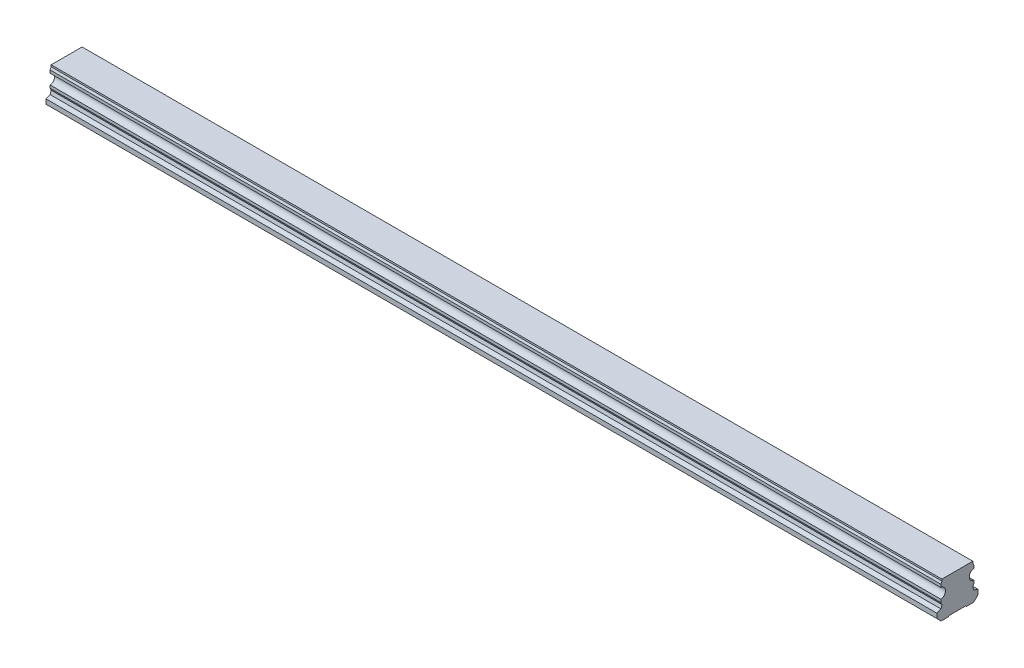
ISO-10303-21;
HEADER;
FILE_DESCRIPTION(('STEP AP214'),'2;1');
FILE_NAME('part.step','',(''),(''),'','','');
FILE_SCHEMA(('AUTOMOTIVE_DESIGN { 1 0 10303 214 1 1 1 1 }'));
ENDSEC;
DATA;
#1=APPLICATION_CONTEXT('core data for automotive mechanical design processes');
#2=APPLICATION_PROTOCOL_DEFINITION('international standard','automotive_design',2000,#1);
#3=PRODUCT_CONTEXT('',#1,'mechanical');
#4=PRODUCT('Part','Part','',(#3));
#5=PRODUCT_RELATED_PRODUCT_CATEGORY('part','',(#4));
#6=PRODUCT_DEFINITION_FORMATION('','',#4);
#7=PRODUCT_DEFINITION_CONTEXT('part definition',#1,'design');
#8=PRODUCT_DEFINITION('design','',#6,#7);
#9=PRODUCT_DEFINITION_SHAPE('','',#8);
#10=(LENGTH_UNIT() NAMED_UNIT(*) SI_UNIT(.MILLI.,.METRE.));
#11=(NAMED_UNIT(*) PLANE_ANGLE_UNIT() SI_UNIT($,.RADIAN.));
#12=(NAMED_UNIT(*) SI_UNIT($,.STERADIAN.) SOLID_ANGLE_UNIT());
#13=UNCERTAINTY_MEASURE_WITH_UNIT(LENGTH_MEASURE(1.E-05),#10,'distance_accuracy_value','');
#14=(GEOMETRIC_REPRESENTATION_CONTEXT(3) GLOBAL_UNCERTAINTY_ASSIGNED_CONTEXT((#13)) GLOBAL_UNIT_ASSIGNED_CONTEXT((#10,
#11,#12)) REPRESENTATION_CONTEXT('',''));
#15=CARTESIAN_POINT('',(0.,0.,0.));
#16=DIRECTION('',(0.,0.,1.));
#17=DIRECTION('',(1.,0.,0.));
#18=AXIS2_PLACEMENT_3D('',#15,#16,#17);
#19=CARTESIAN_POINT('',(510.,0.499999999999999,0.));
#20=DIRECTION('',(0.,-1.,0.));
#21=DIRECTION('',(0.,0.,-1.));
#22=AXIS2_PLACEMENT_3D('',#19,#20,#21);
#23=CONICAL_SURFACE('',#22,3.5,0.785398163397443);
#24=CARTESIAN_POINT('',(510.,1.00000000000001,0.));
#25=DIRECTION('',(0.,1.,0.));
#26=DIRECTION('',(0.,0.,1.));
#27=AXIS2_PLACEMENT_3D('',#24,#25,#26);
#28=CIRCLE('',#27,3.);
#29=CARTESIAN_POINT('',(510.,1.00000000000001,3.));
#30=VERTEX_POINT('',#29);
#31=EDGE_CURVE('E11',#30,#30,#28,.F.);
#32=ORIENTED_EDGE('',*,*,#31,.F.);
#33=EDGE_LOOP('',(#32));
#34=FACE_BOUND('',#33,.T.);
#35=CARTESIAN_POINT('',(510.,0.499999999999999,0.));
#36=DIRECTION('',(0.,1.,0.));
#37=DIRECTION('',(0.,0.,1.));
#38=AXIS2_PLACEMENT_3D('',#35,#36,#37);
#39=CIRCLE('',#38,3.5);
#40=CARTESIAN_POINT('',(510.,0.5,3.5));
#41=VERTEX_POINT('',#40);
#42=EDGE_CURVE('E505',#41,#41,#39,.T.);
#43=ORIENTED_EDGE('',*,*,#42,.F.);
#44=EDGE_LOOP('',(#43));
#45=FACE_BOUND('',#44,.T.);
#46=ADVANCED_FACE('F39',(#34,#45),#23,.F.);
#47=CARTESIAN_POINT('',(510.,12.,0.));
#48=DIRECTION('',(0.,-1.,0.));
#49=DIRECTION('',(0.,0.,-1.));
#50=AXIS2_PLACEMENT_3D('',#47,#48,#49);
#51=CYLINDRICAL_SURFACE('',#50,3.);
#52=ORIENTED_EDGE('',*,*,#31,.T.);
#53=EDGE_LOOP('',(#52));
#54=FACE_BOUND('',#53,.T.);
#55=CARTESIAN_POINT('',(510.,12.,0.));
#56=DIRECTION('',(0.,-1.,0.));
#57=DIRECTION('',(0.,0.,-1.));
#58=AXIS2_PLACEMENT_3D('',#55,#56,#57);
#59=CIRCLE('',#58,3.);
#60=CARTESIAN_POINT('',(510.,12.,-3.));
#61=VERTEX_POINT('',#60);
#62=EDGE_CURVE('E49',#61,#61,#59,.T.);
#63=ORIENTED_EDGE('',*,*,#62,.F.);
#64=EDGE_LOOP('',(#63));
#65=FACE_BOUND('',#64,.T.);
#66=ADVANCED_FACE('F668',(#54,#65),#51,.F.);
#67=CARTESIAN_POINT('',(510.,12.,0.));
#68=DIRECTION('',(0.,-1.,0.));
#69=DIRECTION('',(0.,0.,-1.));
#70=AXIS2_PLACEMENT_3D('',#67,#68,#69);
#71=PLANE('',#70);
#72=CARTESIAN_POINT('',(510.,12.,0.));
#73=DIRECTION('',(0.,-1.,0.));
#74=DIRECTION('',(0.,0.,-1.));
#75=AXIS2_PLACEMENT_3D('',#72,#73,#74);
#76=CIRCLE('',#75,2.5);
#77=CARTESIAN_POINT('',(510.,12.,-2.5));
#78=VERTEX_POINT('',#77);
#79=EDGE_CURVE('E42',#78,#78,#76,.T.);
#80=ORIENTED_EDGE('',*,*,#79,.F.);
#81=EDGE_LOOP('',(#80));
#82=FACE_BOUND('',#81,.T.);
#83=ORIENTED_EDGE('',*,*,#62,.T.);
#84=EDGE_LOOP('',(#83));
#85=FACE_BOUND('',#84,.T.);
#86=ADVANCED_FACE('F673',(#82,#85),#71,.T.);
#87=CARTESIAN_POINT('',(450.,0.499999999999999,0.));
#88=DIRECTION('',(0.,-1.,0.));
#89=DIRECTION('',(0.,0.,-1.));
#90=AXIS2_PLACEMENT_3D('',#87,#88,#89);
#91=CONICAL_SURFACE('',#90,3.5,0.785398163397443);
#92=CARTESIAN_POINT('',(450.,1.00000000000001,0.));
#93=DIRECTION('',(0.,1.,0.));
#94=DIRECTION('',(0.,0.,1.));
#95=AXIS2_PLACEMENT_3D('',#92,#93,#94);
#96=CIRCLE('',#95,3.);
#97=CARTESIAN_POINT('',(450.,1.00000000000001,3.));
#98=VERTEX_POINT('',#97);
#99=EDGE_CURVE('E501',#98,#98,#96,.F.);
#100=ORIENTED_EDGE('',*,*,#99,.F.);
#101=EDGE_LOOP('',(#100));
#102=FACE_BOUND('',#101,.T.);
#103=CARTESIAN_POINT('',(450.,0.499999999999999,0.));
#104=DIRECTION('',(0.,1.,0.));
#105=DIRECTION('',(0.,0.,1.));
#106=AXIS2_PLACEMENT_3D('',#103,#104,#105);
#107=CIRCLE('',#106,3.5);
#108=CARTESIAN_POINT('',(450.,0.5,3.5));
#109=VERTEX_POINT('',#108);
#110=EDGE_CURVE('E493',#109,#109,#107,.T.);
#111=ORIENTED_EDGE('',*,*,#110,.F.);
#112=EDGE_LOOP('',(#111));
#113=FACE_BOUND('',#112,.T.);
#114=ADVANCED_FACE('F818',(#102,#113),#91,.F.);
#115=CARTESIAN_POINT('',(450.,12.,0.));
#116=DIRECTION('',(0.,-1.,0.));
#117=DIRECTION('',(0.,0.,-1.));
#118=AXIS2_PLACEMENT_3D('',#115,#116,#117);
#119=CYLINDRICAL_SURFACE('',#118,3.);
#120=ORIENTED_EDGE('',*,*,#99,.T.);
#121=EDGE_LOOP('',(#120));
#122=FACE_BOUND('',#121,.T.);
#123=CARTESIAN_POINT('',(450.,12.,0.));
#124=DIRECTION('',(0.,-1.,0.));
#125=DIRECTION('',(0.,0.,-1.));
#126=AXIS2_PLACEMENT_3D('',#123,#124,#125);
#127=CIRCLE('',#126,3.);
#128=CARTESIAN_POINT('',(450.,12.,-3.));
#129=VERTEX_POINT('',#128);
#130=EDGE_CURVE('E497',#129,#129,#127,.T.);
#131=ORIENTED_EDGE('',*,*,#130,.F.);
#132=EDGE_LOOP('',(#131));
#133=FACE_BOUND('',#132,.T.);
#134=ADVANCED_FACE('F814',(#122,#133),#119,.F.);
#135=CARTESIAN_POINT('',(450.,12.,0.));
#136=DIRECTION('',(0.,-1.,0.));
#137=DIRECTION('',(0.,0.,-1.));
#138=AXIS2_PLACEMENT_3D('',#135,#136,#137);
#139=PLANE('',#138);
#140=CARTESIAN_POINT('',(450.,12.,0.));
#141=DIRECTION('',(0.,-1.,0.));
#142=DIRECTION('',(0.,0.,-1.));
#143=AXIS2_PLACEMENT_3D('',#140,#141,#142);
#144=CIRCLE('',#143,2.5);
#145=CARTESIAN_POINT('',(450.,12.,-2.5));
#146=VERTEX_POINT('',#145);
#147=EDGE_CURVE('E536',#146,#146,#144,.T.);
#148=ORIENTED_EDGE('',*,*,#147,.F.);
#149=EDGE_LOOP('',(#148));
#150=FACE_BOUND('',#149,.T.);
#151=ORIENTED_EDGE('',*,*,#130,.T.);
#152=EDGE_LOOP('',(#151));
#153=FACE_BOUND('',#152,.T.);
#154=ADVANCED_FACE('F810',(#150,#153),#139,.T.);
#155=CARTESIAN_POINT('',(390.,0.499999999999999,0.));
#156=DIRECTION('',(0.,-1.,0.));
#157=DIRECTION('',(0.,0.,-1.));
#158=AXIS2_PLACEMENT_3D('',#155,#156,#157);
#159=CONICAL_SURFACE('',#158,3.5,0.785398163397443);
#160=CARTESIAN_POINT('',(390.,1.00000000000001,0.));
#161=DIRECTION('',(0.,1.,0.));
#162=DIRECTION('',(0.,0.,1.));
#163=AXIS2_PLACEMENT_3D('',#160,#161,#162);
#164=CIRCLE('',#163,3.);
#165=CARTESIAN_POINT('',(390.,1.00000000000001,3.));
#166=VERTEX_POINT('',#165);
#167=EDGE_CURVE('E489',#166,#166,#164,.F.);
#168=ORIENTED_EDGE('',*,*,#167,.F.);
#169=EDGE_LOOP('',(#168));
#170=FACE_BOUND('',#169,.T.);
#171=CARTESIAN_POINT('',(390.,0.499999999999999,0.));
#172=DIRECTION('',(0.,1.,0.));
#173=DIRECTION('',(0.,0.,1.));
#174=AXIS2_PLACEMENT_3D('',#171,#172,#173);
#175=CIRCLE('',#174,3.5);
#176=CARTESIAN_POINT('',(390.,0.5,3.5));
#177=VERTEX_POINT('',#176);
#178=EDGE_CURVE('E481',#177,#177,#175,.T.);
#179=ORIENTED_EDGE('',*,*,#178,.F.);
#180=EDGE_LOOP('',(#179));
#181=FACE_BOUND('',#180,.T.);
#182=ADVANCED_FACE('F806',(#170,#181),#159,.F.);
#183=CARTESIAN_POINT('',(390.,12.,0.));
#184=DIRECTION('',(0.,-1.,0.));
#185=DIRECTION('',(0.,0.,-1.));
#186=AXIS2_PLACEMENT_3D('',#183,#184,#185);
#187=CYLINDRICAL_SURFACE('',#186,3.);
#188=ORIENTED_EDGE('',*,*,#167,.T.);
#189=EDGE_LOOP('',(#188));
#190=FACE_BOUND('',#189,.T.);
#191=CARTESIAN_POINT('',(390.,12.,0.));
#192=DIRECTION('',(0.,-1.,0.));
#193=DIRECTION('',(0.,0.,-1.));
#194=AXIS2_PLACEMENT_3D('',#191,#192,#193);
#195=CIRCLE('',#194,3.);
#196=CARTESIAN_POINT('',(390.,12.,-3.));
#197=VERTEX_POINT('',#196);
#198=EDGE_CURVE('E485',#197,#197,#195,.T.);
#199=ORIENTED_EDGE('',*,*,#198,.F.);
#200=EDGE_LOOP('',(#199));
#201=FACE_BOUND('',#200,.T.);
#202=ADVANCED_FACE('F802',(#190,#201),#187,.F.);
#203=CARTESIAN_POINT('',(390.,12.,0.));
#204=DIRECTION('',(0.,-1.,0.));
#205=DIRECTION('',(0.,0.,-1.));
#206=AXIS2_PLACEMENT_3D('',#203,#204,#205);
#207=PLANE('',#206);
#208=CARTESIAN_POINT('',(390.,12.,0.));
#209=DIRECTION('',(0.,-1.,0.));
#210=DIRECTION('',(0.,0.,-1.));
#211=AXIS2_PLACEMENT_3D('',#208,#209,#210);
#212=CIRCLE('',#211,2.5);
#213=CARTESIAN_POINT('',(390.,12.,-2.5));
#214=VERTEX_POINT('',#213);
#215=EDGE_CURVE('E533',#214,#214,#212,.T.);
#216=ORIENTED_EDGE('',*,*,#215,.F.);
#217=EDGE_LOOP('',(#216));
#218=FACE_BOUND('',#217,.T.);
#219=ORIENTED_EDGE('',*,*,#198,.T.);
#220=EDGE_LOOP('',(#219));
#221=FACE_BOUND('',#220,.T.);
#222=ADVANCED_FACE('F798',(#218,#221),#207,.T.);
#223=CARTESIAN_POINT('',(330.,0.499999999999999,0.));
#224=DIRECTION('',(0.,-1.,0.));
#225=DIRECTION('',(0.,0.,-1.));
#226=AXIS2_PLACEMENT_3D('',#223,#224,#225);
#227=CONICAL_SURFACE('',#226,3.5,0.785398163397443);
#228=CARTESIAN_POINT('',(330.,1.00000000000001,0.));
#229=DIRECTION('',(0.,1.,0.));
#230=DIRECTION('',(0.,0.,1.));
#231=AXIS2_PLACEMENT_3D('',#228,#229,#230);
#232=CIRCLE('',#231,3.);
#233=CARTESIAN_POINT('',(330.,1.00000000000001,3.));
#234=VERTEX_POINT('',#233);
#235=EDGE_CURVE('E477',#234,#234,#232,.F.);
#236=ORIENTED_EDGE('',*,*,#235,.F.);
#237=EDGE_LOOP('',(#236));
#238=FACE_BOUND('',#237,.T.);
#239=CARTESIAN_POINT('',(330.,0.499999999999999,0.));
#240=DIRECTION('',(0.,1.,0.));
#241=DIRECTION('',(0.,0.,1.));
#242=AXIS2_PLACEMENT_3D('',#239,#240,#241);
#243=CIRCLE('',#242,3.5);
#244=CARTESIAN_POINT('',(330.,0.5,3.5));
#245=VERTEX_POINT('',#244);
#246=EDGE_CURVE('E469',#245,#245,#243,.T.);
#247=ORIENTED_EDGE('',*,*,#246,.F.);
#248=EDGE_LOOP('',(#247));
#249=FACE_BOUND('',#248,.T.);
#250=ADVANCED_FACE('F794',(#238,#249),#227,.F.);
#251=CARTESIAN_POINT('',(330.,12.,0.));
#252=DIRECTION('',(0.,-1.,0.));
#253=DIRECTION('',(0.,0.,-1.));
#254=AXIS2_PLACEMENT_3D('',#251,#252,#253);
#255=CYLINDRICAL_SURFACE('',#254,3.);
#256=ORIENTED_EDGE('',*,*,#235,.T.);
#257=EDGE_LOOP('',(#256));
#258=FACE_BOUND('',#257,.T.);
#259=CARTESIAN_POINT('',(330.,12.,0.));
#260=DIRECTION('',(0.,-1.,0.));
#261=DIRECTION('',(0.,0.,-1.));
#262=AXIS2_PLACEMENT_3D('',#259,#260,#261);
#263=CIRCLE('',#262,3.);
#264=CARTESIAN_POINT('',(330.,12.,-3.));
#265=VERTEX_POINT('',#264);
#266=EDGE_CURVE('E473',#265,#265,#263,.T.);
#267=ORIENTED_EDGE('',*,*,#266,.F.);
#268=EDGE_LOOP('',(#267));
#269=FACE_BOUND('',#268,.T.);
#270=ADVANCED_FACE('F790',(#258,#269),#255,.F.);
#271=CARTESIAN_POINT('',(330.,12.,0.));
#272=DIRECTION('',(0.,-1.,0.));
#273=DIRECTION('',(0.,0.,-1.));
#274=AXIS2_PLACEMENT_3D('',#271,#272,#273);
#275=PLANE('',#274);
#276=CARTESIAN_POINT('',(330.,12.,0.));
#277=DIRECTION('',(0.,-1.,0.));
#278=DIRECTION('',(0.,0.,-1.));
#279=AXIS2_PLACEMENT_3D('',#276,#277,#278);
#280=CIRCLE('',#279,2.5);
#281=CARTESIAN_POINT('',(330.,12.,-2.5));
#282=VERTEX_POINT('',#281);
#283=EDGE_CURVE('E529',#282,#282,#280,.T.);
#284=ORIENTED_EDGE('',*,*,#283,.F.);
#285=EDGE_LOOP('',(#284));
#286=FACE_BOUND('',#285,.T.);
#287=ORIENTED_EDGE('',*,*,#266,.T.);
#288=EDGE_LOOP('',(#287));
#289=FACE_BOUND('',#288,.T.);
#290=ADVANCED_FACE('F786',(#286,#289),#275,.T.);
#291=CARTESIAN_POINT('',(270.,0.499999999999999,0.));
#292=DIRECTION('',(0.,-1.,0.));
#293=DIRECTION('',(0.,0.,-1.));
#294=AXIS2_PLACEMENT_3D('',#291,#292,#293);
#295=CONICAL_SURFACE('',#294,3.5,0.785398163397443);
#296=CARTESIAN_POINT('',(270.,1.00000000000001,0.));
#297=DIRECTION('',(0.,1.,0.));
#298=DIRECTION('',(0.,0.,1.));
#299=AXIS2_PLACEMENT_3D('',#296,#297,#298);
#300=CIRCLE('',#299,3.);
#301=CARTESIAN_POINT('',(270.,1.00000000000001,3.));
#302=VERTEX_POINT('',#301);
#303=EDGE_CURVE('E465',#302,#302,#300,.F.);
#304=ORIENTED_EDGE('',*,*,#303,.F.);
#305=EDGE_LOOP('',(#304));
#306=FACE_BOUND('',#305,.T.);
#307=CARTESIAN_POINT('',(270.,0.499999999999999,0.));
#308=DIRECTION('',(0.,1.,0.));
#309=DIRECTION('',(0.,0.,1.));
#310=AXIS2_PLACEMENT_3D('',#307,#308,#309);
#311=CIRCLE('',#310,3.5);
#312=CARTESIAN_POINT('',(270.,0.5,3.5));
#313=VERTEX_POINT('',#312);
#314=EDGE_CURVE('E457',#313,#313,#311,.T.);
#315=ORIENTED_EDGE('',*,*,#314,.F.);
#316=EDGE_LOOP('',(#315));
#317=FACE_BOUND('',#316,.T.);
#318=ADVANCED_FACE('F782',(#306,#317),#295,.F.);
#319=CARTESIAN_POINT('',(270.,12.,0.));
#320=DIRECTION('',(0.,-1.,0.));
#321=DIRECTION('',(0.,0.,-1.));
#322=AXIS2_PLACEMENT_3D('',#319,#320,#321);
#323=CYLINDRICAL_SURFACE('',#322,3.);
#324=ORIENTED_EDGE('',*,*,#303,.T.);
#325=EDGE_LOOP('',(#324));
#326=FACE_BOUND('',#325,.T.);
#327=CARTESIAN_POINT('',(270.,12.,0.));
#328=DIRECTION('',(0.,-1.,0.));
#329=DIRECTION('',(0.,0.,-1.));
#330=AXIS2_PLACEMENT_3D('',#327,#328,#329);
#331=CIRCLE('',#330,3.);
#332=CARTESIAN_POINT('',(270.,12.,-3.));
#333=VERTEX_POINT('',#332);
#334=EDGE_CURVE('E461',#333,#333,#331,.T.);
#335=ORIENTED_EDGE('',*,*,#334,.F.);
#336=EDGE_LOOP('',(#335));
#337=FACE_BOUND('',#336,.T.);
#338=ADVANCED_FACE('F778',(#326,#337),#323,.F.);
#339=CARTESIAN_POINT('',(270.,12.,0.));
#340=DIRECTION('',(0.,-1.,0.));
#341=DIRECTION('',(0.,0.,-1.));
#342=AXIS2_PLACEMENT_3D('',#339,#340,#341);
#343=PLANE('',#342);
#344=CARTESIAN_POINT('',(270.,12.,0.));
#345=DIRECTION('',(0.,-1.,0.));
#346=DIRECTION('',(0.,0.,-1.));
#347=AXIS2_PLACEMENT_3D('',#344,#345,#346);
#348=CIRCLE('',#347,2.5);
#349=CARTESIAN_POINT('',(270.,12.,-2.5));
#350=VERTEX_POINT('',#349);
#351=EDGE_CURVE('E525',#350,#350,#348,.T.);
#352=ORIENTED_EDGE('',*,*,#351,.F.);
#353=EDGE_LOOP('',(#352));
#354=FACE_BOUND('',#353,.T.);
#355=ORIENTED_EDGE('',*,*,#334,.T.);
#356=EDGE_LOOP('',(#355));
#357=FACE_BOUND('',#356,.T.);
#358=ADVANCED_FACE('F774',(#354,#357),#343,.T.);
#359=CARTESIAN_POINT('',(210.,0.499999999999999,0.));
#360=DIRECTION('',(0.,-1.,0.));
#361=DIRECTION('',(0.,0.,-1.));
#362=AXIS2_PLACEMENT_3D('',#359,#360,#361);
#363=CONICAL_SURFACE('',#362,3.5,0.785398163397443);
#364=CARTESIAN_POINT('',(210.,1.00000000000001,0.));
#365=DIRECTION('',(0.,1.,0.));
#366=DIRECTION('',(0.,0.,1.));
#367=AXIS2_PLACEMENT_3D('',#364,#365,#366);
#368=CIRCLE('',#367,3.);
#369=CARTESIAN_POINT('',(210.,1.00000000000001,3.));
#370=VERTEX_POINT('',#369);
#371=EDGE_CURVE('E453',#370,#370,#368,.F.);
#372=ORIENTED_EDGE('',*,*,#371,.F.);
#373=EDGE_LOOP('',(#372));
#374=FACE_BOUND('',#373,.T.);
#375=CARTESIAN_POINT('',(210.,0.499999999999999,0.));
#376=DIRECTION('',(0.,1.,0.));
#377=DIRECTION('',(0.,0.,1.));
#378=AXIS2_PLACEMENT_3D('',#375,#376,#377);
#379=CIRCLE('',#378,3.5);
#380=CARTESIAN_POINT('',(210.,0.5,3.5));
#381=VERTEX_POINT('',#380);
#382=EDGE_CURVE('E445',#381,#381,#379,.T.);
#383=ORIENTED_EDGE('',*,*,#382,.F.);
#384=EDGE_LOOP('',(#383));
#385=FACE_BOUND('',#384,.T.);
#386=ADVANCED_FACE('F770',(#374,#385),#363,.F.);
#387=CARTESIAN_POINT('',(210.,12.,0.));
#388=DIRECTION('',(0.,-1.,0.));
#389=DIRECTION('',(0.,0.,-1.));
#390=AXIS2_PLACEMENT_3D('',#387,#388,#389);
#391=CYLINDRICAL_SURFACE('',#390,3.);
#392=ORIENTED_EDGE('',*,*,#371,.T.);
#393=EDGE_LOOP('',(#392));
#394=FACE_BOUND('',#393,.T.);
#395=CARTESIAN_POINT('',(210.,12.,0.));
#396=DIRECTION('',(0.,-1.,0.));
#397=DIRECTION('',(0.,0.,-1.));
#398=AXIS2_PLACEMENT_3D('',#395,#396,#397);
#399=CIRCLE('',#398,3.);
#400=CARTESIAN_POINT('',(210.,12.,-3.));
#401=VERTEX_POINT('',#400);
#402=EDGE_CURVE('E449',#401,#401,#399,.T.);
#403=ORIENTED_EDGE('',*,*,#402,.F.);
#404=EDGE_LOOP('',(#403));
#405=FACE_BOUND('',#404,.T.);
#406=ADVANCED_FACE('F766',(#394,#405),#391,.F.);
#407=CARTESIAN_POINT('',(210.,12.,0.));
#408=DIRECTION('',(0.,-1.,0.));
#409=DIRECTION('',(0.,0.,-1.));
#410=AXIS2_PLACEMENT_3D('',#407,#408,#409);
#411=PLANE('',#410);
#412=CARTESIAN_POINT('',(210.,12.,0.));
#413=DIRECTION('',(0.,-1.,0.));
#414=DIRECTION('',(0.,0.,-1.));
#415=AXIS2_PLACEMENT_3D('',#412,#413,#414);
#416=CIRCLE('',#415,2.5);
#417=CARTESIAN_POINT('',(210.,12.,-2.5));
#418=VERTEX_POINT('',#417);
#419=EDGE_CURVE('E521',#418,#418,#416,.T.);
#420=ORIENTED_EDGE('',*,*,#419,.F.);
#421=EDGE_LOOP('',(#420));
#422=FACE_BOUND('',#421,.T.);
#423=ORIENTED_EDGE('',*,*,#402,.T.);
#424=EDGE_LOOP('',(#423));
#425=FACE_BOUND('',#424,.T.);
#426=ADVANCED_FACE('F762',(#422,#425),#411,.T.);
#427=CARTESIAN_POINT('',(150.,0.499999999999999,0.));
#428=DIRECTION('',(0.,-1.,0.));
#429=DIRECTION('',(0.,0.,-1.));
#430=AXIS2_PLACEMENT_3D('',#427,#428,#429);
#431=CONICAL_SURFACE('',#430,3.5,0.785398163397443);
#432=CARTESIAN_POINT('',(150.,1.00000000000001,0.));
#433=DIRECTION('',(0.,1.,0.));
#434=DIRECTION('',(0.,0.,1.));
#435=AXIS2_PLACEMENT_3D('',#432,#433,#434);
#436=CIRCLE('',#435,3.);
#437=CARTESIAN_POINT('',(150.,1.00000000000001,3.));
#438=VERTEX_POINT('',#437);
#439=EDGE_CURVE('E441',#438,#438,#436,.F.);
#440=ORIENTED_EDGE('',*,*,#439,.F.);
#441=EDGE_LOOP('',(#440));
#442=FACE_BOUND('',#441,.T.);
#443=CARTESIAN_POINT('',(150.,0.499999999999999,0.));
#444=DIRECTION('',(0.,1.,0.));
#445=DIRECTION('',(0.,0.,1.));
#446=AXIS2_PLACEMENT_3D('',#443,#444,#445);
#447=CIRCLE('',#446,3.5);
#448=CARTESIAN_POINT('',(150.,0.5,3.5));
#449=VERTEX_POINT('',#448);
#450=EDGE_CURVE('E433',#449,#449,#447,.T.);
#451=ORIENTED_EDGE('',*,*,#450,.F.);
#452=EDGE_LOOP('',(#451));
#453=FACE_BOUND('',#452,.T.);
#454=ADVANCED_FACE('F758',(#442,#453),#431,.F.);
#455=CARTESIAN_POINT('',(150.,12.,0.));
#456=DIRECTION('',(0.,-1.,0.));
#457=DIRECTION('',(0.,0.,-1.));
#458=AXIS2_PLACEMENT_3D('',#455,#456,#457);
#459=CYLINDRICAL_SURFACE('',#458,3.);
#460=ORIENTED_EDGE('',*,*,#439,.T.);
#461=EDGE_LOOP('',(#460));
#462=FACE_BOUND('',#461,.T.);
#463=CARTESIAN_POINT('',(150.,12.,0.));
#464=DIRECTION('',(0.,-1.,0.));
#465=DIRECTION('',(0.,0.,-1.));
#466=AXIS2_PLACEMENT_3D('',#463,#464,#465);
#467=CIRCLE('',#466,3.);
#468=CARTESIAN_POINT('',(150.,12.,-3.));
#469=VERTEX_POINT('',#468);
#470=EDGE_CURVE('E437',#469,#469,#467,.T.);
#471=ORIENTED_EDGE('',*,*,#470,.F.);
#472=EDGE_LOOP('',(#471));
#473=FACE_BOUND('',#472,.T.);
#474=ADVANCED_FACE('F754',(#462,#473),#459,.F.);
#475=CARTESIAN_POINT('',(150.,12.,0.));
#476=DIRECTION('',(0.,-1.,0.));
#477=DIRECTION('',(0.,0.,-1.));
#478=AXIS2_PLACEMENT_3D('',#475,#476,#477);
#479=PLANE('',#478);
#480=CARTESIAN_POINT('',(150.,12.,0.));
#481=DIRECTION('',(0.,-1.,0.));
#482=DIRECTION('',(0.,0.,-1.));
#483=AXIS2_PLACEMENT_3D('',#480,#481,#482);
#484=CIRCLE('',#483,2.5);
#485=CARTESIAN_POINT('',(150.,12.,-2.5));
#486=VERTEX_POINT('',#485);
#487=EDGE_CURVE('E516',#486,#486,#484,.T.);
#488=ORIENTED_EDGE('',*,*,#487,.F.);
#489=EDGE_LOOP('',(#488));
#490=FACE_BOUND('',#489,.T.);
#491=ORIENTED_EDGE('',*,*,#470,.T.);
#492=EDGE_LOOP('',(#491));
#493=FACE_BOUND('',#492,.T.);
#494=ADVANCED_FACE('F745',(#490,#493),#479,.T.);
#495=CARTESIAN_POINT('',(540.,21.8,-9.375));
#496=DIRECTION('',(0.,0.,1.));
#497=DIRECTION('',(0.,-1.,0.));
#498=AXIS2_PLACEMENT_3D('',#495,#496,#497);
#499=PLANE('',#498);
#500=DIRECTION('',(0.,1.,0.));
#501=VECTOR('',#500,1.);
#502=CARTESIAN_POINT('',(0.,21.8,-9.375));
#503=LINE('',#502,#501);
#504=CARTESIAN_POINT('',(0.,20.756,-9.375));
#505=VERTEX_POINT('',#504);
#506=CARTESIAN_POINT('',(0.,21.8,-9.375));
#507=VERTEX_POINT('',#506);
#508=EDGE_CURVE('E255',#505,#507,#503,.T.);
#509=ORIENTED_EDGE('',*,*,#508,.T.);
#510=DIRECTION('',(-1.,0.,0.));
#511=VECTOR('',#510,1.);
#512=CARTESIAN_POINT('',(540.,21.8,-9.375));
#513=LINE('',#512,#511);
#514=CARTESIAN_POINT('',(540.,21.8,-9.375));
#515=VERTEX_POINT('',#514);
#516=EDGE_CURVE('E422',#515,#507,#513,.T.);
#517=ORIENTED_EDGE('',*,*,#516,.F.);
#518=DIRECTION('',(0.,1.,0.));
#519=VECTOR('',#518,1.);
#520=CARTESIAN_POINT('',(540.,21.8,-9.375));
#521=LINE('',#520,#519);
#522=CARTESIAN_POINT('',(540.,20.756,-9.375));
#523=VERTEX_POINT('',#522);
#524=EDGE_CURVE('E332',#523,#515,#521,.T.);
#525=ORIENTED_EDGE('',*,*,#524,.F.);
#526=DIRECTION('',(-1.,0.,0.));
#527=VECTOR('',#526,1.);
#528=CARTESIAN_POINT('',(540.,20.756,-9.375));
#529=LINE('',#528,#527);
#530=EDGE_CURVE('E251',#523,#505,#529,.T.);
#531=ORIENTED_EDGE('',*,*,#530,.T.);
#532=EDGE_LOOP('',(#509,#517,#525,#531));
#533=FACE_BOUND('',#532,.T.);
#534=ADVANCED_FACE('F655',(#533),#499,.F.);
#535=CARTESIAN_POINT('',(540.,21.8,-9.375));
#536=DIRECTION('',(0.,-1.,0.));
#537=DIRECTION('',(0.,0.,-1.));
#538=AXIS2_PLACEMENT_3D('',#535,#536,#537);
#539=PLANE('',#538);
#540=DIRECTION('',(0.,0.,1.));
#541=VECTOR('',#540,1.);
#542=CARTESIAN_POINT('',(0.,21.8,-9.375));
#543=LINE('',#542,#541);
#544=CARTESIAN_POINT('',(0.,21.8,9.375));
#545=VERTEX_POINT('',#544);
#546=EDGE_CURVE('E259',#507,#545,#543,.T.);
#547=ORIENTED_EDGE('',*,*,#546,.T.);
#548=DIRECTION('',(-1.,0.,0.));
#549=VECTOR('',#548,1.);
#550=CARTESIAN_POINT('',(540.,21.8,9.375));
#551=LINE('',#550,#549);
#552=CARTESIAN_POINT('',(540.,21.8,9.375));
#553=VERTEX_POINT('',#552);
#554=EDGE_CURVE('E418',#553,#545,#551,.T.);
#555=ORIENTED_EDGE('',*,*,#554,.F.);
#556=DIRECTION('',(0.,0.,1.));
#557=VECTOR('',#556,1.);
#558=CARTESIAN_POINT('',(540.,21.8,-9.375));
#559=LINE('',#558,#557);
#560=EDGE_CURVE('E157',#515,#553,#559,.T.);
#561=ORIENTED_EDGE('',*,*,#560,.F.);
#562=ORIENTED_EDGE('',*,*,#516,.T.);
#563=EDGE_LOOP('',(#547,#555,#561,#562));
#564=FACE_BOUND('',#563,.T.);
#565=ADVANCED_FACE('F739',(#564),#539,.F.);
#566=CARTESIAN_POINT('',(540.,21.8,9.375));
#567=DIRECTION('',(0.,0.,-1.));
#568=DIRECTION('',(0.,1.,0.));
#569=AXIS2_PLACEMENT_3D('',#566,#567,#568);
#570=PLANE('',#569);
#571=DIRECTION('',(0.,-1.,0.));
#572=VECTOR('',#571,1.);
#573=CARTESIAN_POINT('',(0.,21.8,9.375));
#574=LINE('',#573,#572);
#575=CARTESIAN_POINT('',(0.,20.756,9.37499999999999));
#576=VERTEX_POINT('',#575);
#577=EDGE_CURVE('E263',#545,#576,#574,.T.);
#578=ORIENTED_EDGE('',*,*,#577,.T.);
#579=DIRECTION('',(-1.,0.,0.));
#580=VECTOR('',#579,1.);
#581=CARTESIAN_POINT('',(540.,20.756,9.37499999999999));
#582=LINE('',#581,#580);
#583=CARTESIAN_POINT('',(540.,20.756,9.37499999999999));
#584=VERTEX_POINT('',#583);
#585=EDGE_CURVE('E414',#584,#576,#582,.T.);
#586=ORIENTED_EDGE('',*,*,#585,.F.);
#587=DIRECTION('',(0.,-1.,0.));
#588=VECTOR('',#587,1.);
#589=CARTESIAN_POINT('',(540.,21.8,9.375));
#590=LINE('',#589,#588);
#591=EDGE_CURVE('E580',#553,#584,#590,.T.);
#592=ORIENTED_EDGE('',*,*,#591,.F.);
#593=ORIENTED_EDGE('',*,*,#554,.T.);
#594=EDGE_LOOP('',(#578,#586,#592,#593));
#595=FACE_BOUND('',#594,.T.);
#596=ADVANCED_FACE('F735',(#595),#570,.F.);
#597=CARTESIAN_POINT('',(540.,20.756,9.37499999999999));
#598=DIRECTION('',(0.,-0.422618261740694,-0.906307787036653));
#599=DIRECTION('',(0.,0.906307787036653,-0.422618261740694));
#600=AXIS2_PLACEMENT_3D('',#597,#598,#599);
#601=PLANE('',#600);
#602=DIRECTION('',(0.,-0.906307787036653,0.422618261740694));
#603=VECTOR('',#602,1.);
#604=CARTESIAN_POINT('',(0.,20.756,9.37499999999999));
#605=LINE('',#604,#603);
#606=CARTESIAN_POINT('',(0.,19.4156831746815,10.));
#607=VERTEX_POINT('',#606);
#608=EDGE_CURVE('E266',#576,#607,#605,.T.);
#609=ORIENTED_EDGE('',*,*,#608,.T.);
#610=DIRECTION('',(-1.,0.,0.));
#611=VECTOR('',#610,1.);
#612=CARTESIAN_POINT('',(540.,19.4156831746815,10.));
#613=LINE('',#612,#611);
#614=CARTESIAN_POINT('',(540.,19.4156831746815,10.));
#615=VERTEX_POINT('',#614);
#616=EDGE_CURVE('E410',#615,#607,#613,.T.);
#617=ORIENTED_EDGE('',*,*,#616,.F.);
#618=DIRECTION('',(0.,-0.906307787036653,0.422618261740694));
#619=VECTOR('',#618,1.);
#620=CARTESIAN_POINT('',(540.,20.756,9.37499999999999));
#621=LINE('',#620,#619);
#622=EDGE_CURVE('E583',#584,#615,#621,.T.);
#623=ORIENTED_EDGE('',*,*,#622,.F.);
#624=ORIENTED_EDGE('',*,*,#585,.T.);
#625=EDGE_LOOP('',(#609,#617,#623,#624));
#626=FACE_BOUND('',#625,.T.);
#627=ADVANCED_FACE('F731',(#626),#601,.F.);
#628=CARTESIAN_POINT('',(540.,19.4156831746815,10.));
#629=DIRECTION('',(0.,0.,-1.));
#630=DIRECTION('',(-1.,0.,0.));
#631=AXIS2_PLACEMENT_3D('',#628,#629,#630);
#632=PLANE('',#631);
#633=DIRECTION('',(0.,-1.,0.));
#634=VECTOR('',#633,1.);
#635=CARTESIAN_POINT('',(0.,19.4156831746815,10.));
#636=LINE('',#635,#634);
#637=CARTESIAN_POINT('',(0.,17.6854497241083,10.));
#638=VERTEX_POINT('',#637);
#639=EDGE_CURVE('E269',#607,#638,#636,.T.);
#640=ORIENTED_EDGE('',*,*,#639,.T.);
#641=DIRECTION('',(-1.,0.,0.));
#642=VECTOR('',#641,1.);
#643=CARTESIAN_POINT('',(540.,17.6854497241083,10.));
#644=LINE('',#643,#642);
#645=CARTESIAN_POINT('',(540.,17.6854497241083,10.));
#646=VERTEX_POINT('',#645);
#647=EDGE_CURVE('E406',#646,#638,#644,.T.);
#648=ORIENTED_EDGE('',*,*,#647,.F.);
#649=DIRECTION('',(0.,-1.,0.));
#650=VECTOR('',#649,1.);
#651=CARTESIAN_POINT('',(540.,19.4156831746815,10.));
#652=LINE('',#651,#650);
#653=EDGE_CURVE('E586',#615,#646,#652,.T.);
#654=ORIENTED_EDGE('',*,*,#653,.F.);
#655=ORIENTED_EDGE('',*,*,#616,.T.);
#656=EDGE_LOOP('',(#640,#648,#654,#655));
#657=FACE_BOUND('',#656,.T.);
#658=ADVANCED_FACE('F727',(#657),#632,.F.);
#659=CARTESIAN_POINT('',(540.,14.6,10.3));
#660=DIRECTION('',(-1.,0.,0.));
#661=DIRECTION('',(0.,0.,1.));
#662=AXIS2_PLACEMENT_3D('',#659,#660,#661);
#663=CYLINDRICAL_SURFACE('',#662,3.1);
#664=CARTESIAN_POINT('',(0.,14.6,10.3));
#665=DIRECTION('',(-1.,0.,0.));
#666=DIRECTION('',(0.,0.,-1.));
#667=AXIS2_PLACEMENT_3D('',#664,#665,#666);
#668=CIRCLE('',#667,3.1);
#669=CARTESIAN_POINT('',(0.,11.5145502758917,10.));
#670=VERTEX_POINT('',#669);
#671=EDGE_CURVE('E272',#638,#670,#668,.T.);
#672=ORIENTED_EDGE('',*,*,#671,.T.);
#673=DIRECTION('',(-1.,0.,0.));
#674=VECTOR('',#673,1.);
#675=CARTESIAN_POINT('',(540.,11.5145502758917,10.));
#676=LINE('',#675,#674);
#677=CARTESIAN_POINT('',(540.,11.5145502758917,10.));
#678=VERTEX_POINT('',#677);
#679=EDGE_CURVE('E402',#678,#670,#676,.T.);
#680=ORIENTED_EDGE('',*,*,#679,.F.);
#681=CARTESIAN_POINT('',(540.,14.6,10.3));
#682=DIRECTION('',(-1.,0.,0.));
#683=DIRECTION('',(0.,0.,-1.));
#684=AXIS2_PLACEMENT_3D('',#681,#682,#683);
#685=CIRCLE('',#684,3.1);
#686=EDGE_CURVE('E589',#646,#678,#685,.T.);
#687=ORIENTED_EDGE('',*,*,#686,.F.);
#688=ORIENTED_EDGE('',*,*,#647,.T.);
#689=EDGE_LOOP('',(#672,#680,#687,#688));
#690=FACE_BOUND('',#689,.T.);
#691=ADVANCED_FACE('F723',(#690),#663,.F.);
#692=CARTESIAN_POINT('',(540.,9.78431682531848,10.));
#693=DIRECTION('',(0.,0.,-1.));
#694=DIRECTION('',(0.,1.,0.));
#695=AXIS2_PLACEMENT_3D('',#692,#693,#694);
#696=PLANE('',#695);
#697=DIRECTION('',(0.,-1.,0.));
#698=VECTOR('',#697,1.);
#699=CARTESIAN_POINT('',(0.,9.78431682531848,10.));
#700=LINE('',#699,#698);
#701=CARTESIAN_POINT('',(0.,9.78431682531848,10.));
#702=VERTEX_POINT('',#701);
#703=EDGE_CURVE('E275',#670,#702,#700,.T.);
#704=ORIENTED_EDGE('',*,*,#703,.T.);
#705=DIRECTION('',(-1.,0.,0.));
#706=VECTOR('',#705,1.);
#707=CARTESIAN_POINT('',(540.,9.78431682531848,10.));
#708=LINE('',#707,#706);
#709=CARTESIAN_POINT('',(540.,9.78431682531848,10.));
#710=VERTEX_POINT('',#709);
#711=EDGE_CURVE('E398',#710,#702,#708,.T.);
#712=ORIENTED_EDGE('',*,*,#711,.F.);
#713=DIRECTION('',(0.,-1.,0.));
#714=VECTOR('',#713,1.);
#715=CARTESIAN_POINT('',(540.,9.78431682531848,10.));
#716=LINE('',#715,#714);
#717=EDGE_CURVE('E592',#678,#710,#716,.T.);
#718=ORIENTED_EDGE('',*,*,#717,.F.);
#719=ORIENTED_EDGE('',*,*,#679,.T.);
#720=EDGE_LOOP('',(#704,#712,#718,#719));
#721=FACE_BOUND('',#720,.T.);
#722=ADVANCED_FACE('F719',(#721),#696,.F.);
#723=CARTESIAN_POINT('',(540.,8.44400000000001,9.375));
#724=DIRECTION('',(0.,0.4226182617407,-0.90630778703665));
#725=DIRECTION('',(0.,0.90630778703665,0.4226182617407));
#726=AXIS2_PLACEMENT_3D('',#723,#724,#725);
#727=PLANE('',#726);
#728=DIRECTION('',(0.,-0.90630778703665,-0.4226182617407));
#729=VECTOR('',#728,1.);
#730=CARTESIAN_POINT('',(0.,8.44400000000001,9.375));
#731=LINE('',#730,#729);
#732=CARTESIAN_POINT('',(0.,8.44400000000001,9.375));
#733=VERTEX_POINT('',#732);
#734=EDGE_CURVE('E278',#702,#733,#731,.T.);
#735=ORIENTED_EDGE('',*,*,#734,.T.);
#736=DIRECTION('',(-1.,0.,0.));
#737=VECTOR('',#736,1.);
#738=CARTESIAN_POINT('',(540.,8.44400000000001,9.375));
#739=LINE('',#738,#737);
#740=CARTESIAN_POINT('',(540.,8.44400000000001,9.375));
#741=VERTEX_POINT('',#740);
#742=EDGE_CURVE('E394',#741,#733,#739,.T.);
#743=ORIENTED_EDGE('',*,*,#742,.F.);
#744=DIRECTION('',(0.,-0.90630778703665,-0.4226182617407));
#745=VECTOR('',#744,1.);
#746=CARTESIAN_POINT('',(540.,8.44400000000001,9.375));
#747=LINE('',#746,#745);
#748=EDGE_CURVE('E594',#710,#741,#747,.T.);
#749=ORIENTED_EDGE('',*,*,#748,.F.);
#750=ORIENTED_EDGE('',*,*,#711,.T.);
#751=EDGE_LOOP('',(#735,#743,#749,#750));
#752=FACE_BOUND('',#751,.T.);
#753=ADVANCED_FACE('F715',(#752),#727,.F.);
#754=CARTESIAN_POINT('',(540.,6.4,9.92268814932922));
#755=DIRECTION('',(0.,-0.258819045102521,-0.965925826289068));
#756=DIRECTION('',(0.,0.965925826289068,-0.258819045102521));
#757=AXIS2_PLACEMENT_3D('',#754,#755,#756);
#758=PLANE('',#757);
#759=DIRECTION('',(0.,-0.965925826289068,0.258819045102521));
#760=VECTOR('',#759,1.);
#761=CARTESIAN_POINT('',(0.,6.4,9.92268814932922));
#762=LINE('',#761,#760);
#763=CARTESIAN_POINT('',(0.,6.4,9.92268814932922));
#764=VERTEX_POINT('',#763);
#765=EDGE_CURVE('E281',#733,#764,#762,.T.);
#766=ORIENTED_EDGE('',*,*,#765,.T.);
#767=DIRECTION('',(-1.,0.,0.));
#768=VECTOR('',#767,1.);
#769=CARTESIAN_POINT('',(540.,6.4,9.92268814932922));
#770=LINE('',#769,#768);
#771=CARTESIAN_POINT('',(540.,6.4,9.92268814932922));
#772=VERTEX_POINT('',#771);
#773=EDGE_CURVE('E390',#772,#764,#770,.T.);
#774=ORIENTED_EDGE('',*,*,#773,.F.);
#775=DIRECTION('',(0.,-0.965925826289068,0.258819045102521));
#776=VECTOR('',#775,1.);
#777=CARTESIAN_POINT('',(540.,6.4,9.92268814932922));
#778=LINE('',#777,#776);
#779=EDGE_CURVE('E597',#741,#772,#778,.T.);
#780=ORIENTED_EDGE('',*,*,#779,.F.);
#781=ORIENTED_EDGE('',*,*,#742,.T.);
#782=EDGE_LOOP('',(#766,#774,#780,#781));
#783=FACE_BOUND('',#782,.T.);
#784=ADVANCED_FACE('F711',(#783),#758,.F.);
#785=CARTESIAN_POINT('',(540.,5.48933857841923,12.5));
#786=DIRECTION('',(0.,-0.942872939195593,-0.333152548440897));
#787=DIRECTION('',(0.,0.333152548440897,-0.942872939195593));
#788=AXIS2_PLACEMENT_3D('',#785,#786,#787);
#789=PLANE('',#788);
#790=DIRECTION('',(0.,-0.333152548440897,0.942872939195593));
#791=VECTOR('',#790,1.);
#792=CARTESIAN_POINT('',(0.,5.48933857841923,12.5));
#793=LINE('',#792,#791);
#794=CARTESIAN_POINT('',(0.,5.48933857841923,12.5));
#795=VERTEX_POINT('',#794);
#796=EDGE_CURVE('E284',#764,#795,#793,.T.);
#797=ORIENTED_EDGE('',*,*,#796,.T.);
#798=DIRECTION('',(-1.,0.,0.));
#799=VECTOR('',#798,1.);
#800=CARTESIAN_POINT('',(540.,5.48933857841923,12.5));
#801=LINE('',#800,#799);
#802=CARTESIAN_POINT('',(540.,5.48933857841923,12.5));
#803=VERTEX_POINT('',#802);
#804=EDGE_CURVE('E386',#803,#795,#801,.T.);
#805=ORIENTED_EDGE('',*,*,#804,.F.);
#806=DIRECTION('',(0.,-0.333152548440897,0.942872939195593));
#807=VECTOR('',#806,1.);
#808=CARTESIAN_POINT('',(540.,5.48933857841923,12.5));
#809=LINE('',#808,#807);
#810=EDGE_CURVE('E600',#772,#803,#809,.T.);
#811=ORIENTED_EDGE('',*,*,#810,.F.);
#812=ORIENTED_EDGE('',*,*,#773,.T.);
#813=EDGE_LOOP('',(#797,#805,#811,#812));
#814=FACE_BOUND('',#813,.T.);
#815=ADVANCED_FACE('F707',(#814),#789,.F.);
#816=CARTESIAN_POINT('',(540.,2.65,12.5));
#817=DIRECTION('',(0.,0.,-1.));
#818=DIRECTION('',(0.,1.,0.));
#819=AXIS2_PLACEMENT_3D('',#816,#817,#818);
#820=PLANE('',#819);
#821=DIRECTION('',(0.,-1.,0.));
#822=VECTOR('',#821,1.);
#823=CARTESIAN_POINT('',(0.,2.65,12.5));
#824=LINE('',#823,#822);
#825=CARTESIAN_POINT('',(0.,2.65,12.5));
#826=VERTEX_POINT('',#825);
#827=EDGE_CURVE('E287',#795,#826,#824,.T.);
#828=ORIENTED_EDGE('',*,*,#827,.T.);
#829=DIRECTION('',(-1.,0.,0.));
#830=VECTOR('',#829,1.);
#831=CARTESIAN_POINT('',(540.,2.65,12.5));
#832=LINE('',#831,#830);
#833=CARTESIAN_POINT('',(540.,2.65,12.5));
#834=VERTEX_POINT('',#833);
#835=EDGE_CURVE('E382',#834,#826,#832,.T.);
#836=ORIENTED_EDGE('',*,*,#835,.F.);
#837=DIRECTION('',(0.,-1.,0.));
#838=VECTOR('',#837,1.);
#839=CARTESIAN_POINT('',(540.,2.65,12.5));
#840=LINE('',#839,#838);
#841=EDGE_CURVE('E603',#803,#834,#840,.T.);
#842=ORIENTED_EDGE('',*,*,#841,.F.);
#843=ORIENTED_EDGE('',*,*,#804,.T.);
#844=EDGE_LOOP('',(#828,#836,#842,#843));
#845=FACE_BOUND('',#844,.T.);
#846=ADVANCED_FACE('F703',(#845),#820,.F.);
#847=CARTESIAN_POINT('',(540.,0.,9.85));
#848=DIRECTION('',(0.,0.707106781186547,-0.707106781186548));
#849=DIRECTION('',(0.,0.707106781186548,0.707106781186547));
#850=AXIS2_PLACEMENT_3D('',#847,#848,#849);
#851=PLANE('',#850);
#852=DIRECTION('',(0.,-0.707106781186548,-0.707106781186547));
#853=VECTOR('',#852,1.);
#854=CARTESIAN_POINT('',(0.,0.,9.85));
#855=LINE('',#854,#853);
#856=CARTESIAN_POINT('',(0.,0.,9.85));
#857=VERTEX_POINT('',#856);
#858=EDGE_CURVE('E290',#826,#857,#855,.T.);
#859=ORIENTED_EDGE('',*,*,#858,.T.);
#860=DIRECTION('',(-1.,0.,0.));
#861=VECTOR('',#860,1.);
#862=CARTESIAN_POINT('',(540.,0.,9.85));
#863=LINE('',#862,#861);
#864=CARTESIAN_POINT('',(540.,0.,9.85));
#865=VERTEX_POINT('',#864);
#866=EDGE_CURVE('E378',#865,#857,#863,.T.);
#867=ORIENTED_EDGE('',*,*,#866,.F.);
#868=DIRECTION('',(0.,-0.707106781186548,-0.707106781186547));
#869=VECTOR('',#868,1.);
#870=CARTESIAN_POINT('',(540.,0.,9.85));
#871=LINE('',#870,#869);
#872=EDGE_CURVE('E606',#834,#865,#871,.T.);
#873=ORIENTED_EDGE('',*,*,#872,.F.);
#874=ORIENTED_EDGE('',*,*,#835,.T.);
#875=EDGE_LOOP('',(#859,#867,#873,#874));
#876=FACE_BOUND('',#875,.T.);
#877=ADVANCED_FACE('F699',(#876),#851,.F.);
#878=CARTESIAN_POINT('',(540.,0.,5.5));
#879=DIRECTION('',(0.,1.,0.));
#880=DIRECTION('',(0.,0.,1.));
#881=AXIS2_PLACEMENT_3D('',#878,#879,#880);
#882=PLANE('',#881);
#883=DIRECTION('',(0.,0.,-1.));
#884=VECTOR('',#883,1.);
#885=CARTESIAN_POINT('',(0.,0.,5.5));
#886=LINE('',#885,#884);
#887=CARTESIAN_POINT('',(0.,0.,5.5));
#888=VERTEX_POINT('',#887);
#889=EDGE_CURVE('E293',#857,#888,#886,.T.);
#890=ORIENTED_EDGE('',*,*,#889,.T.);
#891=DIRECTION('',(-1.,0.,0.));
#892=VECTOR('',#891,1.);
#893=CARTESIAN_POINT('',(540.,0.,5.5));
#894=LINE('',#893,#892);
#895=CARTESIAN_POINT('',(540.,0.,5.5));
#896=VERTEX_POINT('',#895);
#897=EDGE_CURVE('E374',#896,#888,#894,.T.);
#898=ORIENTED_EDGE('',*,*,#897,.F.);
#899=DIRECTION('',(0.,0.,-1.));
#900=VECTOR('',#899,1.);
#901=CARTESIAN_POINT('',(540.,0.,5.5));
#902=LINE('',#901,#900);
#903=EDGE_CURVE('E609',#865,#896,#902,.T.);
#904=ORIENTED_EDGE('',*,*,#903,.F.);
#905=ORIENTED_EDGE('',*,*,#866,.T.);
#906=EDGE_LOOP('',(#890,#898,#904,#905));
#907=FACE_BOUND('',#906,.T.);
#908=ADVANCED_FACE('F691',(#907),#882,.F.);
#909=CARTESIAN_POINT('',(540.,0.5,5.));
#910=DIRECTION('',(0.,0.707106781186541,0.707106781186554));
#911=DIRECTION('',(0.,-0.707106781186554,0.707106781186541));
#912=AXIS2_PLACEMENT_3D('',#909,#910,#911);
#913=PLANE('',#912);
#914=DIRECTION('',(0.,0.707106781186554,-0.707106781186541));
#915=VECTOR('',#914,1.);
#916=CARTESIAN_POINT('',(0.,0.5,5.));
#917=LINE('',#916,#915);
#918=CARTESIAN_POINT('',(0.,0.5,5.));
#919=VERTEX_POINT('',#918);
#920=EDGE_CURVE('E296',#888,#919,#917,.T.);
#921=ORIENTED_EDGE('',*,*,#920,.T.);
#922=DIRECTION('',(-1.,0.,0.));
#923=VECTOR('',#922,1.);
#924=CARTESIAN_POINT('',(540.,0.5,5.));
#925=LINE('',#924,#923);
#926=CARTESIAN_POINT('',(540.,0.5,5.));
#927=VERTEX_POINT('',#926);
#928=EDGE_CURVE('E370',#927,#919,#925,.T.);
#929=ORIENTED_EDGE('',*,*,#928,.F.);
#930=DIRECTION('',(0.,0.707106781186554,-0.707106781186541));
#931=VECTOR('',#930,1.);
#932=CARTESIAN_POINT('',(540.,0.5,5.));
#933=LINE('',#932,#931);
#934=EDGE_CURVE('E612',#896,#927,#933,.T.);
#935=ORIENTED_EDGE('',*,*,#934,.F.);
#936=ORIENTED_EDGE('',*,*,#897,.T.);
#937=EDGE_LOOP('',(#921,#929,#935,#936));
#938=FACE_BOUND('',#937,.T.);
#939=ADVANCED_FACE('F682',(#938),#913,.F.);
#940=CARTESIAN_POINT('',(540.,0.499999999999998,-5.));
#941=DIRECTION('',(0.,1.,0.));
#942=DIRECTION('',(0.,0.,1.));
#943=AXIS2_PLACEMENT_3D('',#940,#941,#942);
#944=PLANE('',#943);
#945=CARTESIAN_POINT('',(90.,0.499999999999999,0.));
#946=DIRECTION('',(0.,1.,0.));
#947=DIRECTION('',(0.,0.,1.));
#948=AXIS2_PLACEMENT_3D('',#945,#946,#947);
#949=CIRCLE('',#948,3.5);
#950=CARTESIAN_POINT('',(90.,0.5,3.5));
#951=VERTEX_POINT('',#950);
#952=EDGE_CURVE('E543',#951,#951,#949,.T.);
#953=ORIENTED_EDGE('',*,*,#952,.T.);
#954=EDGE_LOOP('',(#953));
#955=FACE_BOUND('',#954,.T.);
#956=CARTESIAN_POINT('',(30.,0.499999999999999,0.));
#957=DIRECTION('',(0.,1.,0.));
#958=DIRECTION('',(0.,0.,1.));
#959=AXIS2_PLACEMENT_3D('',#956,#957,#958);
#960=CIRCLE('',#959,3.5);
#961=CARTESIAN_POINT('',(30.,0.5,3.5));
#962=VERTEX_POINT('',#961);
#963=EDGE_CURVE('E425',#962,#962,#960,.T.);
#964=ORIENTED_EDGE('',*,*,#963,.T.);
#965=EDGE_LOOP('',(#964));
#966=FACE_BOUND('',#965,.T.);
#967=DIRECTION('',(0.,0.,-1.));
#968=VECTOR('',#967,1.);
#969=CARTESIAN_POINT('',(0.,0.499999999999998,-5.));
#970=LINE('',#969,#968);
#971=CARTESIAN_POINT('',(0.,0.499999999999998,-5.));
#972=VERTEX_POINT('',#971);
#973=EDGE_CURVE('E299',#919,#972,#970,.T.);
#974=ORIENTED_EDGE('',*,*,#973,.T.);
#975=DIRECTION('',(-1.,0.,0.));
#976=VECTOR('',#975,1.);
#977=CARTESIAN_POINT('',(540.,0.499999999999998,-5.));
#978=LINE('',#977,#976);
#979=CARTESIAN_POINT('',(540.,0.499999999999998,-5.));
#980=VERTEX_POINT('',#979);
#981=EDGE_CURVE('E366',#980,#972,#978,.T.);
#982=ORIENTED_EDGE('',*,*,#981,.F.);
#983=DIRECTION('',(0.,0.,-1.));
#984=VECTOR('',#983,1.);
#985=CARTESIAN_POINT('',(540.,0.499999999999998,-5.));
#986=LINE('',#985,#984);
#987=EDGE_CURVE('E615',#927,#980,#986,.T.);
#988=ORIENTED_EDGE('',*,*,#987,.F.);
#989=ORIENTED_EDGE('',*,*,#928,.T.);
#990=EDGE_LOOP('',(#974,#982,#988,#989));
#991=FACE_BOUND('',#990,.T.);
#992=ORIENTED_EDGE('',*,*,#450,.T.);
#993=EDGE_LOOP('',(#992));
#994=FACE_BOUND('',#993,.T.);
#995=ORIENTED_EDGE('',*,*,#382,.T.);
#996=EDGE_LOOP('',(#995));
#997=FACE_BOUND('',#996,.T.);
#998=ORIENTED_EDGE('',*,*,#314,.T.);
#999=EDGE_LOOP('',(#998));
#1000=FACE_BOUND('',#999,.T.);
#1001=ORIENTED_EDGE('',*,*,#246,.T.);
#1002=EDGE_LOOP('',(#1001));
#1003=FACE_BOUND('',#1002,.T.);
#1004=ORIENTED_EDGE('',*,*,#178,.T.);
#1005=EDGE_LOOP('',(#1004));
#1006=FACE_BOUND('',#1005,.T.);
#1007=ORIENTED_EDGE('',*,*,#110,.T.);
#1008=EDGE_LOOP('',(#1007));
#1009=FACE_BOUND('',#1008,.T.);
#1010=ORIENTED_EDGE('',*,*,#42,.T.);
#1011=EDGE_LOOP('',(#1010));
#1012=FACE_BOUND('',#1011,.T.);
#1013=ADVANCED_FACE('F679',(#955,#966,#991,#994,#997,#1000,#1003,#1006,#1009,#1012),#944,.F.);
#1014=CARTESIAN_POINT('',(540.,0.,-5.5));
#1015=DIRECTION('',(0.,0.707106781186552,-0.707106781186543));
#1016=DIRECTION('',(0.,0.707106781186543,0.707106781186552));
#1017=AXIS2_PLACEMENT_3D('',#1014,#1015,#1016);
#1018=PLANE('',#1017);
#1019=DIRECTION('',(0.,-0.707106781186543,-0.707106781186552));
#1020=VECTOR('',#1019,1.);
#1021=CARTESIAN_POINT('',(0.,0.,-5.5));
#1022=LINE('',#1021,#1020);
#1023=CARTESIAN_POINT('',(0.,0.,-5.5));
#1024=VERTEX_POINT('',#1023);
#1025=EDGE_CURVE('E302',#972,#1024,#1022,.T.);
#1026=ORIENTED_EDGE('',*,*,#1025,.T.);
#1027=DIRECTION('',(-1.,0.,0.));
#1028=VECTOR('',#1027,1.);
#1029=CARTESIAN_POINT('',(540.,0.,-5.5));
#1030=LINE('',#1029,#1028);
#1031=CARTESIAN_POINT('',(540.,0.,-5.5));
#1032=VERTEX_POINT('',#1031);
#1033=EDGE_CURVE('E362',#1032,#1024,#1030,.T.);
#1034=ORIENTED_EDGE('',*,*,#1033,.F.);
#1035=DIRECTION('',(0.,-0.707106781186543,-0.707106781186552));
#1036=VECTOR('',#1035,1.);
#1037=CARTESIAN_POINT('',(540.,0.,-5.5));
#1038=LINE('',#1037,#1036);
#1039=EDGE_CURVE('E618',#980,#1032,#1038,.T.);
#1040=ORIENTED_EDGE('',*,*,#1039,.F.);
#1041=ORIENTED_EDGE('',*,*,#981,.T.);
#1042=EDGE_LOOP('',(#1026,#1034,#1040,#1041));
#1043=FACE_BOUND('',#1042,.T.);
#1044=ADVANCED_FACE('F681',(#1043),#1018,.F.);
#1045=CARTESIAN_POINT('',(540.,0.,-9.85));
#1046=DIRECTION('',(0.,1.,0.));
#1047=DIRECTION('',(0.,0.,1.));
#1048=AXIS2_PLACEMENT_3D('',#1045,#1046,#1047);
#1049=PLANE('',#1048);
#1050=DIRECTION('',(0.,0.,-1.));
#1051=VECTOR('',#1050,1.);
#1052=CARTESIAN_POINT('',(0.,0.,-9.85));
#1053=LINE('',#1052,#1051);
#1054=CARTESIAN_POINT('',(0.,0.,-9.85));
#1055=VERTEX_POINT('',#1054);
#1056=EDGE_CURVE('E305',#1024,#1055,#1053,.T.);
#1057=ORIENTED_EDGE('',*,*,#1056,.T.);
#1058=DIRECTION('',(-1.,0.,0.));
#1059=VECTOR('',#1058,1.);
#1060=CARTESIAN_POINT('',(540.,0.,-9.85));
#1061=LINE('',#1060,#1059);
#1062=CARTESIAN_POINT('',(540.,0.,-9.85));
#1063=VERTEX_POINT('',#1062);
#1064=EDGE_CURVE('E358',#1063,#1055,#1061,.T.);
#1065=ORIENTED_EDGE('',*,*,#1064,.F.);
#1066=DIRECTION('',(0.,0.,-1.));
#1067=VECTOR('',#1066,1.);
#1068=CARTESIAN_POINT('',(540.,0.,-9.85));
#1069=LINE('',#1068,#1067);
#1070=EDGE_CURVE('E621',#1032,#1063,#1069,.T.);
#1071=ORIENTED_EDGE('',*,*,#1070,.F.);
#1072=ORIENTED_EDGE('',*,*,#1033,.T.);
#1073=EDGE_LOOP('',(#1057,#1065,#1071,#1072));
#1074=FACE_BOUND('',#1073,.T.);
#1075=ADVANCED_FACE('F688',(#1074),#1049,.F.);
#1076=CARTESIAN_POINT('',(540.,2.65,-12.5));
#1077=DIRECTION('',(0.,0.707106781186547,0.707106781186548));
#1078=DIRECTION('',(0.,-0.707106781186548,0.707106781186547));
#1079=AXIS2_PLACEMENT_3D('',#1076,#1077,#1078);
#1080=PLANE('',#1079);
#1081=DIRECTION('',(0.,0.707106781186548,-0.707106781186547));
#1082=VECTOR('',#1081,1.);
#1083=CARTESIAN_POINT('',(0.,2.65,-12.5));
#1084=LINE('',#1083,#1082);
#1085=CARTESIAN_POINT('',(0.,2.65,-12.5));
#1086=VERTEX_POINT('',#1085);
#1087=EDGE_CURVE('E308',#1055,#1086,#1084,.T.);
#1088=ORIENTED_EDGE('',*,*,#1087,.T.);
#1089=DIRECTION('',(-1.,0.,0.));
#1090=VECTOR('',#1089,1.);
#1091=CARTESIAN_POINT('',(540.,2.65,-12.5));
#1092=LINE('',#1091,#1090);
#1093=CARTESIAN_POINT('',(540.,2.65,-12.5));
#1094=VERTEX_POINT('',#1093);
#1095=EDGE_CURVE('E354',#1094,#1086,#1092,.T.);
#1096=ORIENTED_EDGE('',*,*,#1095,.F.);
#1097=DIRECTION('',(0.,0.707106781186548,-0.707106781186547));
#1098=VECTOR('',#1097,1.);
#1099=CARTESIAN_POINT('',(540.,2.65,-12.5));
#1100=LINE('',#1099,#1098);
#1101=EDGE_CURVE('E624',#1063,#1094,#1100,.T.);
#1102=ORIENTED_EDGE('',*,*,#1101,.F.);
#1103=ORIENTED_EDGE('',*,*,#1064,.T.);
#1104=EDGE_LOOP('',(#1088,#1096,#1102,#1103));
#1105=FACE_BOUND('',#1104,.T.);
#1106=ADVANCED_FACE('F944',(#1105),#1080,.F.);
#1107=CARTESIAN_POINT('',(540.,5.48933857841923,-12.5));
#1108=DIRECTION('',(0.,0.,1.));
#1109=DIRECTION('',(0.,-1.,0.));
#1110=AXIS2_PLACEMENT_3D('',#1107,#1108,#1109);
#1111=PLANE('',#1110);
#1112=DIRECTION('',(0.,1.,0.));
#1113=VECTOR('',#1112,1.);
#1114=CARTESIAN_POINT('',(0.,5.48933857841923,-12.5));
#1115=LINE('',#1114,#1113);
#1116=CARTESIAN_POINT('',(0.,5.48933857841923,-12.5));
#1117=VERTEX_POINT('',#1116);
#1118=EDGE_CURVE('E311',#1086,#1117,#1115,.T.);
#1119=ORIENTED_EDGE('',*,*,#1118,.T.);
#1120=DIRECTION('',(-1.,0.,0.));
#1121=VECTOR('',#1120,1.);
#1122=CARTESIAN_POINT('',(540.,5.48933857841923,-12.5));
#1123=LINE('',#1122,#1121);
#1124=CARTESIAN_POINT('',(540.,5.48933857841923,-12.5));
#1125=VERTEX_POINT('',#1124);
#1126=EDGE_CURVE('E350',#1125,#1117,#1123,.T.);
#1127=ORIENTED_EDGE('',*,*,#1126,.F.);
#1128=DIRECTION('',(0.,1.,0.));
#1129=VECTOR('',#1128,1.);
#1130=CARTESIAN_POINT('',(540.,5.48933857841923,-12.5));
#1131=LINE('',#1130,#1129);
#1132=EDGE_CURVE('E627',#1094,#1125,#1131,.T.);
#1133=ORIENTED_EDGE('',*,*,#1132,.F.);
#1134=ORIENTED_EDGE('',*,*,#1095,.T.);
#1135=EDGE_LOOP('',(#1119,#1127,#1133,#1134));
#1136=FACE_BOUND('',#1135,.T.);
#1137=ADVANCED_FACE('F952',(#1136),#1111,.F.);
#1138=CARTESIAN_POINT('',(540.,6.39999999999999,-9.92268814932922));
#1139=DIRECTION('',(0.,-0.942872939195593,0.333152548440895));
#1140=DIRECTION('',(0.,-0.333152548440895,-0.942872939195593));
#1141=AXIS2_PLACEMENT_3D('',#1138,#1139,#1140);
#1142=PLANE('',#1141);
#1143=DIRECTION('',(0.,0.333152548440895,0.942872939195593));
#1144=VECTOR('',#1143,1.);
#1145=CARTESIAN_POINT('',(0.,6.39999999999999,-9.92268814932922));
#1146=LINE('',#1145,#1144);
#1147=CARTESIAN_POINT('',(0.,6.39999999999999,-9.92268814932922));
#1148=VERTEX_POINT('',#1147);
#1149=EDGE_CURVE('E314',#1117,#1148,#1146,.T.);
#1150=ORIENTED_EDGE('',*,*,#1149,.T.);
#1151=DIRECTION('',(-1.,0.,0.));
#1152=VECTOR('',#1151,1.);
#1153=CARTESIAN_POINT('',(540.,6.39999999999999,-9.92268814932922));
#1154=LINE('',#1153,#1152);
#1155=CARTESIAN_POINT('',(540.,6.39999999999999,-9.92268814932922));
#1156=VERTEX_POINT('',#1155);
#1157=EDGE_CURVE('E346',#1156,#1148,#1154,.T.);
#1158=ORIENTED_EDGE('',*,*,#1157,.F.);
#1159=DIRECTION('',(0.,0.333152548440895,0.942872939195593));
#1160=VECTOR('',#1159,1.);
#1161=CARTESIAN_POINT('',(540.,6.39999999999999,-9.92268814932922));
#1162=LINE('',#1161,#1160);
#1163=EDGE_CURVE('E630',#1125,#1156,#1162,.T.);
#1164=ORIENTED_EDGE('',*,*,#1163,.F.);
#1165=ORIENTED_EDGE('',*,*,#1126,.T.);
#1166=EDGE_LOOP('',(#1150,#1158,#1164,#1165));
#1167=FACE_BOUND('',#1166,.T.);
#1168=ADVANCED_FACE('F961',(#1167),#1142,.F.);
#1169=CARTESIAN_POINT('',(540.,8.44400000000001,-9.375));
#1170=DIRECTION('',(0.,-0.258819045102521,0.965925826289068));
#1171=DIRECTION('',(0.,-0.965925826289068,-0.258819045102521));
#1172=AXIS2_PLACEMENT_3D('',#1169,#1170,#1171);
#1173=PLANE('',#1172);
#1174=DIRECTION('',(0.,0.965925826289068,0.258819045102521));
#1175=VECTOR('',#1174,1.);
#1176=CARTESIAN_POINT('',(0.,8.44400000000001,-9.375));
#1177=LINE('',#1176,#1175);
#1178=CARTESIAN_POINT('',(0.,8.44400000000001,-9.375));
#1179=VERTEX_POINT('',#1178);
#1180=EDGE_CURVE('E317',#1148,#1179,#1177,.T.);
#1181=ORIENTED_EDGE('',*,*,#1180,.T.);
#1182=DIRECTION('',(-1.,0.,0.));
#1183=VECTOR('',#1182,1.);
#1184=CARTESIAN_POINT('',(540.,8.44400000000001,-9.375));
#1185=LINE('',#1184,#1183);
#1186=CARTESIAN_POINT('',(540.,8.44400000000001,-9.375));
#1187=VERTEX_POINT('',#1186);
#1188=EDGE_CURVE('E343',#1187,#1179,#1185,.T.);
#1189=ORIENTED_EDGE('',*,*,#1188,.F.);
#1190=DIRECTION('',(0.,0.965925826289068,0.258819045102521));
#1191=VECTOR('',#1190,1.);
#1192=CARTESIAN_POINT('',(540.,8.44400000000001,-9.375));
#1193=LINE('',#1192,#1191);
#1194=EDGE_CURVE('E633',#1156,#1187,#1193,.T.);
#1195=ORIENTED_EDGE('',*,*,#1194,.F.);
#1196=ORIENTED_EDGE('',*,*,#1157,.T.);
#1197=EDGE_LOOP('',(#1181,#1189,#1195,#1196));
#1198=FACE_BOUND('',#1197,.T.);
#1199=ADVANCED_FACE('F970',(#1198),#1173,.F.);
#1200=CARTESIAN_POINT('',(540.,9.78431682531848,-10.));
#1201=DIRECTION('',(0.,0.4226182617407,0.90630778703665));
#1202=DIRECTION('',(0.,-0.90630778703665,0.4226182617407));
#1203=AXIS2_PLACEMENT_3D('',#1200,#1201,#1202);
#1204=PLANE('',#1203);
#1205=DIRECTION('',(0.,0.90630778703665,-0.4226182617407));
#1206=VECTOR('',#1205,1.);
#1207=CARTESIAN_POINT('',(0.,9.78431682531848,-10.));
#1208=LINE('',#1207,#1206);
#1209=CARTESIAN_POINT('',(0.,9.78431682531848,-10.));
#1210=VERTEX_POINT('',#1209);
#1211=EDGE_CURVE('E320',#1179,#1210,#1208,.T.);
#1212=ORIENTED_EDGE('',*,*,#1211,.T.);
#1213=DIRECTION('',(-1.,0.,0.));
#1214=VECTOR('',#1213,1.);
#1215=CARTESIAN_POINT('',(540.,9.78431682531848,-10.));
#1216=LINE('',#1215,#1214);
#1217=CARTESIAN_POINT('',(540.,9.78431682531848,-10.));
#1218=VERTEX_POINT('',#1217);
#1219=EDGE_CURVE('E339',#1218,#1210,#1216,.T.);
#1220=ORIENTED_EDGE('',*,*,#1219,.F.);
#1221=DIRECTION('',(0.,0.90630778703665,-0.4226182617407));
#1222=VECTOR('',#1221,1.);
#1223=CARTESIAN_POINT('',(540.,9.78431682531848,-10.));
#1224=LINE('',#1223,#1222);
#1225=EDGE_CURVE('E636',#1187,#1218,#1224,.T.);
#1226=ORIENTED_EDGE('',*,*,#1225,.F.);
#1227=ORIENTED_EDGE('',*,*,#1188,.T.);
#1228=EDGE_LOOP('',(#1212,#1220,#1226,#1227));
#1229=FACE_BOUND('',#1228,.T.);
#1230=ADVANCED_FACE('F644',(#1229),#1204,.F.);
#1231=CARTESIAN_POINT('',(540.,11.5145502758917,-10.));
#1232=DIRECTION('',(0.,0.,1.));
#1233=DIRECTION('',(1.,0.,0.));
#1234=AXIS2_PLACEMENT_3D('',#1231,#1232,#1233);
#1235=PLANE('',#1234);
#1236=DIRECTION('',(0.,1.,0.));
#1237=VECTOR('',#1236,1.);
#1238=CARTESIAN_POINT('',(0.,11.5145502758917,-10.));
#1239=LINE('',#1238,#1237);
#1240=CARTESIAN_POINT('',(0.,11.5145502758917,-10.));
#1241=VERTEX_POINT('',#1240);
#1242=EDGE_CURVE('E323',#1210,#1241,#1239,.T.);
#1243=ORIENTED_EDGE('',*,*,#1242,.T.);
#1244=DIRECTION('',(-1.,0.,0.));
#1245=VECTOR('',#1244,1.);
#1246=CARTESIAN_POINT('',(540.,11.5145502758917,-10.));
#1247=LINE('',#1246,#1245);
#1248=CARTESIAN_POINT('',(540.,11.5145502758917,-10.));
#1249=VERTEX_POINT('',#1248);
#1250=EDGE_CURVE('E243',#1249,#1241,#1247,.T.);
#1251=ORIENTED_EDGE('',*,*,#1250,.F.);
#1252=DIRECTION('',(0.,1.,0.));
#1253=VECTOR('',#1252,1.);
#1254=CARTESIAN_POINT('',(540.,11.5145502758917,-10.));
#1255=LINE('',#1254,#1253);
#1256=EDGE_CURVE('E232',#1218,#1249,#1255,.T.);
#1257=ORIENTED_EDGE('',*,*,#1256,.F.);
#1258=ORIENTED_EDGE('',*,*,#1219,.T.);
#1259=EDGE_LOOP('',(#1243,#1251,#1257,#1258));
#1260=FACE_BOUND('',#1259,.T.);
#1261=ADVANCED_FACE('F648',(#1260),#1235,.F.);
#1262=CARTESIAN_POINT('',(540.,14.6,-10.3));
#1263=DIRECTION('',(-1.,0.,0.));
#1264=DIRECTION('',(0.,0.,1.));
#1265=AXIS2_PLACEMENT_3D('',#1262,#1263,#1264);
#1266=CYLINDRICAL_SURFACE('',#1265,3.1);
#1267=CARTESIAN_POINT('',(0.,14.6,-10.3));
#1268=DIRECTION('',(-1.,0.,0.));
#1269=DIRECTION('',(0.,0.,-1.));
#1270=AXIS2_PLACEMENT_3D('',#1267,#1268,#1269);
#1271=CIRCLE('',#1270,3.1);
#1272=CARTESIAN_POINT('',(0.,17.6854497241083,-10.));
#1273=VERTEX_POINT('',#1272);
#1274=EDGE_CURVE('E241',#1241,#1273,#1271,.T.);
#1275=ORIENTED_EDGE('',*,*,#1274,.T.);
#1276=DIRECTION('',(-1.,0.,0.));
#1277=VECTOR('',#1276,1.);
#1278=CARTESIAN_POINT('',(540.,17.6854497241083,-10.));
#1279=LINE('',#1278,#1277);
#1280=CARTESIAN_POINT('',(540.,17.6854497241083,-10.));
#1281=VERTEX_POINT('',#1280);
#1282=EDGE_CURVE('E238',#1281,#1273,#1279,.T.);
#1283=ORIENTED_EDGE('',*,*,#1282,.F.);
#1284=CARTESIAN_POINT('',(540.,14.6,-10.3));
#1285=DIRECTION('',(-1.,0.,0.));
#1286=DIRECTION('',(0.,0.,-1.));
#1287=AXIS2_PLACEMENT_3D('',#1284,#1285,#1286);
#1288=CIRCLE('',#1287,3.1);
#1289=EDGE_CURVE('E226',#1249,#1281,#1288,.T.);
#1290=ORIENTED_EDGE('',*,*,#1289,.F.);
#1291=ORIENTED_EDGE('',*,*,#1250,.T.);
#1292=EDGE_LOOP('',(#1275,#1283,#1290,#1291));
#1293=FACE_BOUND('',#1292,.T.);
#1294=ADVANCED_FACE('F239',(#1293),#1266,.F.);
#1295=CARTESIAN_POINT('',(540.,19.4156831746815,-10.));
#1296=DIRECTION('',(0.,0.,1.));
#1297=DIRECTION('',(1.,0.,0.));
#1298=AXIS2_PLACEMENT_3D('',#1295,#1296,#1297);
#1299=PLANE('',#1298);
#1300=DIRECTION('',(0.,1.,0.));
#1301=VECTOR('',#1300,1.);
#1302=CARTESIAN_POINT('',(0.,19.4156831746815,-10.));
#1303=LINE('',#1302,#1301);
#1304=CARTESIAN_POINT('',(0.,19.4156831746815,-10.));
#1305=VERTEX_POINT('',#1304);
#1306=EDGE_CURVE('E142',#1273,#1305,#1303,.T.);
#1307=ORIENTED_EDGE('',*,*,#1306,.T.);
#1308=DIRECTION('',(-1.,0.,0.));
#1309=VECTOR('',#1308,1.);
#1310=CARTESIAN_POINT('',(540.,19.4156831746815,-10.));
#1311=LINE('',#1310,#1309);
#1312=CARTESIAN_POINT('',(540.,19.4156831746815,-10.));
#1313=VERTEX_POINT('',#1312);
#1314=EDGE_CURVE('E244',#1313,#1305,#1311,.T.);
#1315=ORIENTED_EDGE('',*,*,#1314,.F.);
#1316=DIRECTION('',(0.,1.,0.));
#1317=VECTOR('',#1316,1.);
#1318=CARTESIAN_POINT('',(540.,19.4156831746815,-10.));
#1319=LINE('',#1318,#1317);
#1320=EDGE_CURVE('E230',#1281,#1313,#1319,.T.);
#1321=ORIENTED_EDGE('',*,*,#1320,.F.);
#1322=ORIENTED_EDGE('',*,*,#1282,.T.);
#1323=EDGE_LOOP('',(#1307,#1315,#1321,#1322));
#1324=FACE_BOUND('',#1323,.T.);
#1325=ADVANCED_FACE('F246',(#1324),#1299,.F.);
#1326=CARTESIAN_POINT('',(540.,20.756,-9.375));
#1327=DIRECTION('',(0.,-0.422618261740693,0.906307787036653));
#1328=DIRECTION('',(0.,-0.906307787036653,-0.422618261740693));
#1329=AXIS2_PLACEMENT_3D('',#1326,#1327,#1328);
#1330=PLANE('',#1329);
#1331=DIRECTION('',(0.,0.906307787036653,0.422618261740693));
#1332=VECTOR('',#1331,1.);
#1333=CARTESIAN_POINT('',(0.,20.756,-9.375));
#1334=LINE('',#1333,#1332);
#1335=EDGE_CURVE('E148',#1305,#505,#1334,.T.);
#1336=ORIENTED_EDGE('',*,*,#1335,.T.);
#1337=ORIENTED_EDGE('',*,*,#530,.F.);
#1338=DIRECTION('',(0.,0.906307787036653,0.422618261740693));
#1339=VECTOR('',#1338,1.);
#1340=CARTESIAN_POINT('',(540.,20.756,-9.375));
#1341=LINE('',#1340,#1339);
#1342=EDGE_CURVE('E58',#1313,#523,#1341,.T.);
#1343=ORIENTED_EDGE('',*,*,#1342,.F.);
#1344=ORIENTED_EDGE('',*,*,#1314,.T.);
#1345=EDGE_LOOP('',(#1336,#1337,#1343,#1344));
#1346=FACE_BOUND('',#1345,.T.);
#1347=ADVANCED_FACE('F657',(#1346),#1330,.F.);
#1348=CARTESIAN_POINT('',(540.,14.6,-10.3));
#1349=DIRECTION('',(1.,0.,0.));
#1350=DIRECTION('',(0.,0.,-1.));
#1351=AXIS2_PLACEMENT_3D('',#1348,#1349,#1350);
#1352=PLANE('',#1351);
#1353=ORIENTED_EDGE('',*,*,#524,.T.);
#1354=ORIENTED_EDGE('',*,*,#560,.T.);
#1355=ORIENTED_EDGE('',*,*,#591,.T.);
#1356=ORIENTED_EDGE('',*,*,#622,.T.);
#1357=ORIENTED_EDGE('',*,*,#653,.T.);
#1358=ORIENTED_EDGE('',*,*,#686,.T.);
#1359=ORIENTED_EDGE('',*,*,#717,.T.);
#1360=ORIENTED_EDGE('',*,*,#748,.T.);
#1361=ORIENTED_EDGE('',*,*,#779,.T.);
#1362=ORIENTED_EDGE('',*,*,#810,.T.);
#1363=ORIENTED_EDGE('',*,*,#841,.T.);
#1364=ORIENTED_EDGE('',*,*,#872,.T.);
#1365=ORIENTED_EDGE('',*,*,#903,.T.);
#1366=ORIENTED_EDGE('',*,*,#934,.T.);
#1367=ORIENTED_EDGE('',*,*,#987,.T.);
#1368=ORIENTED_EDGE('',*,*,#1039,.T.);
#1369=ORIENTED_EDGE('',*,*,#1070,.T.);
#1370=ORIENTED_EDGE('',*,*,#1101,.T.);
#1371=ORIENTED_EDGE('',*,*,#1132,.T.);
#1372=ORIENTED_EDGE('',*,*,#1163,.T.);
#1373=ORIENTED_EDGE('',*,*,#1194,.T.);
#1374=ORIENTED_EDGE('',*,*,#1225,.T.);
#1375=ORIENTED_EDGE('',*,*,#1256,.T.);
#1376=ORIENTED_EDGE('',*,*,#1289,.T.);
#1377=ORIENTED_EDGE('',*,*,#1320,.T.);
#1378=ORIENTED_EDGE('',*,*,#1342,.T.);
#1379=EDGE_LOOP('',(#1353,#1354,#1355,#1356,#1357,#1358,#1359,#1360,#1361,#1362,#1363,#1364,
#1365,#1366,#1367,#1368,#1369,#1370,#1371,#1372,#1373,#1374,#1375,#1376,#1377,#1378));
#1380=FACE_BOUND('',#1379,.T.);
#1381=ADVANCED_FACE('F228',(#1380),#1352,.T.);
#1382=CARTESIAN_POINT('',(0.,14.6,-10.3));
#1383=DIRECTION('',(1.,0.,0.));
#1384=DIRECTION('',(0.,0.,-1.));
#1385=AXIS2_PLACEMENT_3D('',#1382,#1383,#1384);
#1386=PLANE('',#1385);
#1387=ORIENTED_EDGE('',*,*,#508,.F.);
#1388=ORIENTED_EDGE('',*,*,#1335,.F.);
#1389=ORIENTED_EDGE('',*,*,#1306,.F.);
#1390=ORIENTED_EDGE('',*,*,#1274,.F.);
#1391=ORIENTED_EDGE('',*,*,#1242,.F.);
#1392=ORIENTED_EDGE('',*,*,#1211,.F.);
#1393=ORIENTED_EDGE('',*,*,#1180,.F.);
#1394=ORIENTED_EDGE('',*,*,#1149,.F.);
#1395=ORIENTED_EDGE('',*,*,#1118,.F.);
#1396=ORIENTED_EDGE('',*,*,#1087,.F.);
#1397=ORIENTED_EDGE('',*,*,#1056,.F.);
#1398=ORIENTED_EDGE('',*,*,#1025,.F.);
#1399=ORIENTED_EDGE('',*,*,#973,.F.);
#1400=ORIENTED_EDGE('',*,*,#920,.F.);
#1401=ORIENTED_EDGE('',*,*,#889,.F.);
#1402=ORIENTED_EDGE('',*,*,#858,.F.);
#1403=ORIENTED_EDGE('',*,*,#827,.F.);
#1404=ORIENTED_EDGE('',*,*,#796,.F.);
#1405=ORIENTED_EDGE('',*,*,#765,.F.);
#1406=ORIENTED_EDGE('',*,*,#734,.F.);
#1407=ORIENTED_EDGE('',*,*,#703,.F.);
#1408=ORIENTED_EDGE('',*,*,#671,.F.);
#1409=ORIENTED_EDGE('',*,*,#639,.F.);
#1410=ORIENTED_EDGE('',*,*,#608,.F.);
#1411=ORIENTED_EDGE('',*,*,#577,.F.);
#1412=ORIENTED_EDGE('',*,*,#546,.F.);
#1413=EDGE_LOOP('',(#1387,#1388,#1389,#1390,#1391,#1392,#1393,#1394,#1395,#1396,#1397,#1398,
#1399,#1400,#1401,#1402,#1403,#1404,#1405,#1406,#1407,#1408,#1409,#1410,#1411,#1412));
#1414=FACE_BOUND('',#1413,.T.);
#1415=ADVANCED_FACE('F651',(#1414),#1386,.F.);
#1416=CARTESIAN_POINT('',(30.,12.,0.));
#1417=DIRECTION('',(0.,-1.,0.));
#1418=DIRECTION('',(0.,0.,-1.));
#1419=AXIS2_PLACEMENT_3D('',#1416,#1417,#1418);
#1420=CYLINDRICAL_SURFACE('',#1419,3.);
#1421=CARTESIAN_POINT('',(30.,1.00000000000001,0.));
#1422=DIRECTION('',(0.,1.,0.));
#1423=DIRECTION('',(0.,0.,1.));
#1424=AXIS2_PLACEMENT_3D('',#1421,#1422,#1423);
#1425=CIRCLE('',#1424,3.);
#1426=CARTESIAN_POINT('',(30.,1.00000000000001,3.));
#1427=VERTEX_POINT('',#1426);
#1428=EDGE_CURVE('E429',#1427,#1427,#1425,.F.);
#1429=ORIENTED_EDGE('',*,*,#1428,.T.);
#1430=EDGE_LOOP('',(#1429));
#1431=FACE_BOUND('',#1430,.T.);
#1432=CARTESIAN_POINT('',(30.,12.,0.));
#1433=DIRECTION('',(0.,-1.,0.));
#1434=DIRECTION('',(0.,0.,-1.));
#1435=AXIS2_PLACEMENT_3D('',#1432,#1433,#1434);
#1436=CIRCLE('',#1435,3.);
#1437=CARTESIAN_POINT('',(30.,12.,-3.));
#1438=VERTEX_POINT('',#1437);
#1439=EDGE_CURVE('E260',#1438,#1438,#1436,.T.);
#1440=ORIENTED_EDGE('',*,*,#1439,.F.);
#1441=EDGE_LOOP('',(#1440));
#1442=FACE_BOUND('',#1441,.T.);
#1443=ADVANCED_FACE('F1021',(#1431,#1442),#1420,.F.);
#1444=CARTESIAN_POINT('',(30.,12.,0.));
#1445=DIRECTION('',(0.,-1.,0.));
#1446=DIRECTION('',(0.,0.,-1.));
#1447=AXIS2_PLACEMENT_3D('',#1444,#1445,#1446);
#1448=PLANE('',#1447);
#1449=CARTESIAN_POINT('',(30.,12.,0.));
#1450=DIRECTION('',(0.,-1.,0.));
#1451=DIRECTION('',(0.,0.,-1.));
#1452=AXIS2_PLACEMENT_3D('',#1449,#1450,#1451);
#1453=CIRCLE('',#1452,2.5);
#1454=CARTESIAN_POINT('',(30.,12.,-2.5));
#1455=VERTEX_POINT('',#1454);
#1456=EDGE_CURVE('E569',#1455,#1455,#1453,.T.);
#1457=ORIENTED_EDGE('',*,*,#1456,.F.);
#1458=EDGE_LOOP('',(#1457));
#1459=FACE_BOUND('',#1458,.T.);
#1460=ORIENTED_EDGE('',*,*,#1439,.T.);
#1461=EDGE_LOOP('',(#1460));
#1462=FACE_BOUND('',#1461,.T.);
#1463=ADVANCED_FACE('F1029',(#1459,#1462),#1448,.T.);
#1464=CARTESIAN_POINT('',(30.,15.,0.));
#1465=DIRECTION('',(0.,-1.,0.));
#1466=DIRECTION('',(0.,0.,-1.));
#1467=AXIS2_PLACEMENT_3D('',#1464,#1465,#1466);
#1468=CYLINDRICAL_SURFACE('',#1467,2.5);
#1469=ORIENTED_EDGE('',*,*,#1456,.T.);
#1470=EDGE_LOOP('',(#1469));
#1471=FACE_BOUND('',#1470,.T.);
#1472=CARTESIAN_POINT('',(30.,15.,0.));
#1473=DIRECTION('',(0.,-1.,0.));
#1474=DIRECTION('',(0.,0.,-1.));
#1475=AXIS2_PLACEMENT_3D('',#1472,#1473,#1474);
#1476=CIRCLE('',#1475,2.5);
#1477=CARTESIAN_POINT('',(30.,15.,-2.5));
#1478=VERTEX_POINT('',#1477);
#1479=EDGE_CURVE('E565',#1478,#1478,#1476,.T.);
#1480=ORIENTED_EDGE('',*,*,#1479,.F.);
#1481=EDGE_LOOP('',(#1480));
#1482=FACE_BOUND('',#1481,.T.);
#1483=ADVANCED_FACE('F1039',(#1471,#1482),#1468,.F.);
#1484=CARTESIAN_POINT('',(30.,15.,0.));
#1485=DIRECTION('',(0.,-1.,0.));
#1486=DIRECTION('',(0.,0.,-1.));
#1487=AXIS2_PLACEMENT_3D('',#1484,#1485,#1486);
#1488=CONICAL_SURFACE('',#1487,2.5,1.0471975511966);
#1489=CARTESIAN_POINT('',(30.,16.4433756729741,0.));
#1490=VERTEX_POINT('',#1489);
#1491=VERTEX_LOOP('',#1490);
#1492=FACE_BOUND('',#1491,.T.);
#1493=ORIENTED_EDGE('',*,*,#1479,.T.);
#1494=EDGE_LOOP('',(#1493));
#1495=FACE_BOUND('',#1494,.T.);
#1496=ADVANCED_FACE('F750',(#1492,#1495),#1488,.F.);
#1497=CARTESIAN_POINT('',(30.,0.499999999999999,0.));
#1498=DIRECTION('',(0.,-1.,0.));
#1499=DIRECTION('',(0.,0.,-1.));
#1500=AXIS2_PLACEMENT_3D('',#1497,#1498,#1499);
#1501=CONICAL_SURFACE('',#1500,3.5,0.785398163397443);
#1502=ORIENTED_EDGE('',*,*,#1428,.F.);
#1503=EDGE_LOOP('',(#1502));
#1504=FACE_BOUND('',#1503,.T.);
#1505=ORIENTED_EDGE('',*,*,#963,.F.);
#1506=EDGE_LOOP('',(#1505));
#1507=FACE_BOUND('',#1506,.T.);
#1508=ADVANCED_FACE('F746',(#1504,#1507),#1501,.F.);
#1509=CARTESIAN_POINT('',(90.,12.,0.));
#1510=DIRECTION('',(0.,-1.,0.));
#1511=DIRECTION('',(0.,0.,-1.));
#1512=AXIS2_PLACEMENT_3D('',#1509,#1510,#1511);
#1513=PLANE('',#1512);
#1514=CARTESIAN_POINT('',(90.,12.,0.));
#1515=DIRECTION('',(0.,-1.,0.));
#1516=DIRECTION('',(0.,0.,-1.));
#1517=AXIS2_PLACEMENT_3D('',#1514,#1515,#1516);
#1518=CIRCLE('',#1517,2.5);
#1519=CARTESIAN_POINT('',(90.,12.,-2.5));
#1520=VERTEX_POINT('',#1519);
#1521=EDGE_CURVE('E512',#1520,#1520,#1518,.T.);
#1522=ORIENTED_EDGE('',*,*,#1521,.F.);
#1523=EDGE_LOOP('',(#1522));
#1524=FACE_BOUND('',#1523,.T.);
#1525=CARTESIAN_POINT('',(90.,12.,0.));
#1526=DIRECTION('',(0.,-1.,0.));
#1527=DIRECTION('',(0.,0.,-1.));
#1528=AXIS2_PLACEMENT_3D('',#1525,#1526,#1527);
#1529=CIRCLE('',#1528,3.);
#1530=CARTESIAN_POINT('',(90.,12.,-3.));
#1531=VERTEX_POINT('',#1530);
#1532=EDGE_CURVE('E556',#1531,#1531,#1529,.T.);
#1533=ORIENTED_EDGE('',*,*,#1532,.T.);
#1534=EDGE_LOOP('',(#1533));
#1535=FACE_BOUND('',#1534,.T.);
#1536=ADVANCED_FACE('F749',(#1524,#1535),#1513,.T.);
#1537=CARTESIAN_POINT('',(90.,12.,0.));
#1538=DIRECTION('',(0.,-1.,0.));
#1539=DIRECTION('',(0.,0.,-1.));
#1540=AXIS2_PLACEMENT_3D('',#1537,#1538,#1539);
#1541=CYLINDRICAL_SURFACE('',#1540,3.);
#1542=CARTESIAN_POINT('',(90.,1.00000000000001,0.));
#1543=DIRECTION('',(0.,1.,0.));
#1544=DIRECTION('',(0.,0.,1.));
#1545=AXIS2_PLACEMENT_3D('',#1542,#1543,#1544);
#1546=CIRCLE('',#1545,3.);
#1547=CARTESIAN_POINT('',(90.,1.00000000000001,3.));
#1548=VERTEX_POINT('',#1547);
#1549=EDGE_CURVE('E549',#1548,#1548,#1546,.F.);
#1550=ORIENTED_EDGE('',*,*,#1549,.T.);
#1551=EDGE_LOOP('',(#1550));
#1552=FACE_BOUND('',#1551,.T.);
#1553=ORIENTED_EDGE('',*,*,#1532,.F.);
#1554=EDGE_LOOP('',(#1553));
#1555=FACE_BOUND('',#1554,.T.);
#1556=ADVANCED_FACE('F1067',(#1552,#1555),#1541,.F.);
#1557=CARTESIAN_POINT('',(90.,0.499999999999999,0.));
#1558=DIRECTION('',(0.,-1.,0.));
#1559=DIRECTION('',(0.,0.,-1.));
#1560=AXIS2_PLACEMENT_3D('',#1557,#1558,#1559);
#1561=CONICAL_SURFACE('',#1560,3.5,0.785398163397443);
#1562=ORIENTED_EDGE('',*,*,#1549,.F.);
#1563=EDGE_LOOP('',(#1562));
#1564=FACE_BOUND('',#1563,.T.);
#1565=ORIENTED_EDGE('',*,*,#952,.F.);
#1566=EDGE_LOOP('',(#1565));
#1567=FACE_BOUND('',#1566,.T.);
#1568=ADVANCED_FACE('F1076',(#1564,#1567),#1561,.F.);
#1569=CARTESIAN_POINT('',(90.,15.,0.));
#1570=DIRECTION('',(0.,-1.,0.));
#1571=DIRECTION('',(0.,0.,-1.));
#1572=AXIS2_PLACEMENT_3D('',#1569,#1570,#1571);
#1573=CYLINDRICAL_SURFACE('',#1572,2.5);
#1574=ORIENTED_EDGE('',*,*,#1521,.T.);
#1575=EDGE_LOOP('',(#1574));
#1576=FACE_BOUND('',#1575,.T.);
#1577=CARTESIAN_POINT('',(90.,15.,0.));
#1578=DIRECTION('',(0.,-1.,0.));
#1579=DIRECTION('',(0.,0.,-1.));
#1580=AXIS2_PLACEMENT_3D('',#1577,#1578,#1579);
#1581=CIRCLE('',#1580,2.5);
#1582=CARTESIAN_POINT('',(90.,15.,-2.5));
#1583=VERTEX_POINT('',#1582);
#1584=EDGE_CURVE('E517',#1583,#1583,#1581,.T.);
#1585=ORIENTED_EDGE('',*,*,#1584,.F.);
#1586=EDGE_LOOP('',(#1585));
#1587=FACE_BOUND('',#1586,.T.);
#1588=ADVANCED_FACE('F1085',(#1576,#1587),#1573,.F.);
#1589=CARTESIAN_POINT('',(150.,15.,0.));
#1590=DIRECTION('',(0.,-1.,0.));
#1591=DIRECTION('',(0.,0.,-1.));
#1592=AXIS2_PLACEMENT_3D('',#1589,#1590,#1591);
#1593=CYLINDRICAL_SURFACE('',#1592,2.5);
#1594=ORIENTED_EDGE('',*,*,#487,.T.);
#1595=EDGE_LOOP('',(#1594));
#1596=FACE_BOUND('',#1595,.T.);
#1597=CARTESIAN_POINT('',(150.,15.,0.));
#1598=DIRECTION('',(0.,-1.,0.));
#1599=DIRECTION('',(0.,0.,-1.));
#1600=AXIS2_PLACEMENT_3D('',#1597,#1598,#1599);
#1601=CIRCLE('',#1600,2.5);
#1602=CARTESIAN_POINT('',(150.,15.,-2.5));
#1603=VERTEX_POINT('',#1602);
#1604=EDGE_CURVE('E1453',#1603,#1603,#1601,.T.);
#1605=ORIENTED_EDGE('',*,*,#1604,.F.);
#1606=EDGE_LOOP('',(#1605));
#1607=FACE_BOUND('',#1606,.T.);
#1608=ADVANCED_FACE('F1094',(#1596,#1607),#1593,.F.);
#1609=CARTESIAN_POINT('',(210.,15.,0.));
#1610=DIRECTION('',(0.,-1.,0.));
#1611=DIRECTION('',(0.,0.,-1.));
#1612=AXIS2_PLACEMENT_3D('',#1609,#1610,#1611);
#1613=CYLINDRICAL_SURFACE('',#1612,2.5);
#1614=ORIENTED_EDGE('',*,*,#419,.T.);
#1615=EDGE_LOOP('',(#1614));
#1616=FACE_BOUND('',#1615,.T.);
#1617=CARTESIAN_POINT('',(210.,15.,0.));
#1618=DIRECTION('',(0.,-1.,0.));
#1619=DIRECTION('',(0.,0.,-1.));
#1620=AXIS2_PLACEMENT_3D('',#1617,#1618,#1619);
#1621=CIRCLE('',#1620,2.5);
#1622=CARTESIAN_POINT('',(210.,15.,-2.5));
#1623=VERTEX_POINT('',#1622);
#1624=EDGE_CURVE('E1457',#1623,#1623,#1621,.T.);
#1625=ORIENTED_EDGE('',*,*,#1624,.F.);
#1626=EDGE_LOOP('',(#1625));
#1627=FACE_BOUND('',#1626,.T.);
#1628=ADVANCED_FACE('F1103',(#1616,#1627),#1613,.F.);
#1629=CARTESIAN_POINT('',(270.,15.,0.));
#1630=DIRECTION('',(0.,-1.,0.));
#1631=DIRECTION('',(0.,0.,-1.));
#1632=AXIS2_PLACEMENT_3D('',#1629,#1630,#1631);
#1633=CYLINDRICAL_SURFACE('',#1632,2.5);
#1634=ORIENTED_EDGE('',*,*,#351,.T.);
#1635=EDGE_LOOP('',(#1634));
#1636=FACE_BOUND('',#1635,.T.);
#1637=CARTESIAN_POINT('',(270.,15.,0.));
#1638=DIRECTION('',(0.,-1.,0.));
#1639=DIRECTION('',(0.,0.,-1.));
#1640=AXIS2_PLACEMENT_3D('',#1637,#1638,#1639);
#1641=CIRCLE('',#1640,2.5);
#1642=CARTESIAN_POINT('',(270.,15.,-2.5));
#1643=VERTEX_POINT('',#1642);
#1644=EDGE_CURVE('E1463',#1643,#1643,#1641,.T.);
#1645=ORIENTED_EDGE('',*,*,#1644,.F.);
#1646=EDGE_LOOP('',(#1645));
#1647=FACE_BOUND('',#1646,.T.);
#1648=ADVANCED_FACE('F1112',(#1636,#1647),#1633,.F.);
#1649=CARTESIAN_POINT('',(330.,15.,0.));
#1650=DIRECTION('',(0.,-1.,0.));
#1651=DIRECTION('',(0.,0.,-1.));
#1652=AXIS2_PLACEMENT_3D('',#1649,#1650,#1651);
#1653=CYLINDRICAL_SURFACE('',#1652,2.5);
#1654=ORIENTED_EDGE('',*,*,#283,.T.);
#1655=EDGE_LOOP('',(#1654));
#1656=FACE_BOUND('',#1655,.T.);
#1657=CARTESIAN_POINT('',(330.,15.,0.));
#1658=DIRECTION('',(0.,-1.,0.));
#1659=DIRECTION('',(0.,0.,-1.));
#1660=AXIS2_PLACEMENT_3D('',#1657,#1658,#1659);
#1661=CIRCLE('',#1660,2.5);
#1662=CARTESIAN_POINT('',(330.,15.,-2.5));
#1663=VERTEX_POINT('',#1662);
#1664=EDGE_CURVE('E1466',#1663,#1663,#1661,.T.);
#1665=ORIENTED_EDGE('',*,*,#1664,.F.);
#1666=EDGE_LOOP('',(#1665));
#1667=FACE_BOUND('',#1666,.T.);
#1668=ADVANCED_FACE('F1121',(#1656,#1667),#1653,.F.);
#1669=CARTESIAN_POINT('',(390.,15.,0.));
#1670=DIRECTION('',(0.,-1.,0.));
#1671=DIRECTION('',(0.,0.,-1.));
#1672=AXIS2_PLACEMENT_3D('',#1669,#1670,#1671);
#1673=CYLINDRICAL_SURFACE('',#1672,2.5);
#1674=ORIENTED_EDGE('',*,*,#215,.T.);
#1675=EDGE_LOOP('',(#1674));
#1676=FACE_BOUND('',#1675,.T.);
#1677=CARTESIAN_POINT('',(390.,15.,0.));
#1678=DIRECTION('',(0.,-1.,0.));
#1679=DIRECTION('',(0.,0.,-1.));
#1680=AXIS2_PLACEMENT_3D('',#1677,#1678,#1679);
#1681=CIRCLE('',#1680,2.5);
#1682=CARTESIAN_POINT('',(390.,15.,-2.5));
#1683=VERTEX_POINT('',#1682);
#1684=EDGE_CURVE('E1470',#1683,#1683,#1681,.T.);
#1685=ORIENTED_EDGE('',*,*,#1684,.F.);
#1686=EDGE_LOOP('',(#1685));
#1687=FACE_BOUND('',#1686,.T.);
#1688=ADVANCED_FACE('F1130',(#1676,#1687),#1673,.F.);
#1689=CARTESIAN_POINT('',(450.,15.,0.));
#1690=DIRECTION('',(0.,-1.,0.));
#1691=DIRECTION('',(0.,0.,-1.));
#1692=AXIS2_PLACEMENT_3D('',#1689,#1690,#1691);
#1693=CYLINDRICAL_SURFACE('',#1692,2.5);
#1694=ORIENTED_EDGE('',*,*,#147,.T.);
#1695=EDGE_LOOP('',(#1694));
#1696=FACE_BOUND('',#1695,.T.);
#1697=CARTESIAN_POINT('',(450.,15.,0.));
#1698=DIRECTION('',(0.,-1.,0.));
#1699=DIRECTION('',(0.,0.,-1.));
#1700=AXIS2_PLACEMENT_3D('',#1697,#1698,#1699);
#1701=CIRCLE('',#1700,2.5);
#1702=CARTESIAN_POINT('',(450.,15.,-2.5));
#1703=VERTEX_POINT('',#1702);
#1704=EDGE_CURVE('E1473',#1703,#1703,#1701,.T.);
#1705=ORIENTED_EDGE('',*,*,#1704,.F.);
#1706=EDGE_LOOP('',(#1705));
#1707=FACE_BOUND('',#1706,.T.);
#1708=ADVANCED_FACE('F1139',(#1696,#1707),#1693,.F.);
#1709=CARTESIAN_POINT('',(510.,15.,0.));
#1710=DIRECTION('',(0.,-1.,0.));
#1711=DIRECTION('',(0.,0.,-1.));
#1712=AXIS2_PLACEMENT_3D('',#1709,#1710,#1711);
#1713=CYLINDRICAL_SURFACE('',#1712,2.5);
#1714=ORIENTED_EDGE('',*,*,#79,.T.);
#1715=EDGE_LOOP('',(#1714));
#1716=FACE_BOUND('',#1715,.T.);
#1717=CARTESIAN_POINT('',(510.,15.,0.));
#1718=DIRECTION('',(0.,-1.,0.));
#1719=DIRECTION('',(0.,0.,-1.));
#1720=AXIS2_PLACEMENT_3D('',#1717,#1718,#1719);
#1721=CIRCLE('',#1720,2.5);
#1722=CARTESIAN_POINT('',(510.,15.,-2.5));
#1723=VERTEX_POINT('',#1722);
#1724=EDGE_CURVE('E559',#1723,#1723,#1721,.T.);
#1725=ORIENTED_EDGE('',*,*,#1724,.F.);
#1726=EDGE_LOOP('',(#1725));
#1727=FACE_BOUND('',#1726,.T.);
#1728=ADVANCED_FACE('F1148',(#1716,#1727),#1713,.F.);
#1729=CARTESIAN_POINT('',(510.,15.,0.));
#1730=DIRECTION('',(0.,-1.,0.));
#1731=DIRECTION('',(0.,0.,-1.));
#1732=AXIS2_PLACEMENT_3D('',#1729,#1730,#1731);
#1733=CONICAL_SURFACE('',#1732,2.5,1.0471975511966);
#1734=CARTESIAN_POINT('',(510.,16.4433756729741,0.));
#1735=VERTEX_POINT('',#1734);
#1736=VERTEX_LOOP('',#1735);
#1737=FACE_BOUND('',#1736,.T.);
#1738=ORIENTED_EDGE('',*,*,#1724,.T.);
#1739=EDGE_LOOP('',(#1738));
#1740=FACE_BOUND('',#1739,.T.);
#1741=ADVANCED_FACE('F1156',(#1737,#1740),#1733,.F.);
#1742=CARTESIAN_POINT('',(450.,15.,0.));
#1743=DIRECTION('',(0.,-1.,0.));
#1744=DIRECTION('',(0.,0.,-1.));
#1745=AXIS2_PLACEMENT_3D('',#1742,#1743,#1744);
#1746=CONICAL_SURFACE('',#1745,2.5,1.0471975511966);
#1747=CARTESIAN_POINT('',(450.,16.4433756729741,0.));
#1748=VERTEX_POINT('',#1747);
#1749=VERTEX_LOOP('',#1748);
#1750=FACE_BOUND('',#1749,.T.);
#1751=ORIENTED_EDGE('',*,*,#1704,.T.);
#1752=EDGE_LOOP('',(#1751));
#1753=FACE_BOUND('',#1752,.T.);
#1754=ADVANCED_FACE('F1164',(#1750,#1753),#1746,.F.);
#1755=CARTESIAN_POINT('',(390.,15.,0.));
#1756=DIRECTION('',(0.,-1.,0.));
#1757=DIRECTION('',(0.,0.,-1.));
#1758=AXIS2_PLACEMENT_3D('',#1755,#1756,#1757);
#1759=CONICAL_SURFACE('',#1758,2.5,1.0471975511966);
#1760=CARTESIAN_POINT('',(390.,16.4433756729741,0.));
#1761=VERTEX_POINT('',#1760);
#1762=VERTEX_LOOP('',#1761);
#1763=FACE_BOUND('',#1762,.T.);
#1764=ORIENTED_EDGE('',*,*,#1684,.T.);
#1765=EDGE_LOOP('',(#1764));
#1766=FACE_BOUND('',#1765,.T.);
#1767=ADVANCED_FACE('F1173',(#1763,#1766),#1759,.F.);
#1768=CARTESIAN_POINT('',(330.,15.,0.));
#1769=DIRECTION('',(0.,-1.,0.));
#1770=DIRECTION('',(0.,0.,-1.));
#1771=AXIS2_PLACEMENT_3D('',#1768,#1769,#1770);
#1772=CONICAL_SURFACE('',#1771,2.5,1.0471975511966);
#1773=CARTESIAN_POINT('',(330.,16.4433756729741,0.));
#1774=VERTEX_POINT('',#1773);
#1775=VERTEX_LOOP('',#1774);
#1776=FACE_BOUND('',#1775,.T.);
#1777=ORIENTED_EDGE('',*,*,#1664,.T.);
#1778=EDGE_LOOP('',(#1777));
#1779=FACE_BOUND('',#1778,.T.);
#1780=ADVANCED_FACE('F1182',(#1776,#1779),#1772,.F.);
#1781=CARTESIAN_POINT('',(270.,15.,0.));
#1782=DIRECTION('',(0.,-1.,0.));
#1783=DIRECTION('',(0.,0.,-1.));
#1784=AXIS2_PLACEMENT_3D('',#1781,#1782,#1783);
#1785=CONICAL_SURFACE('',#1784,2.5,1.0471975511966);
#1786=CARTESIAN_POINT('',(270.,16.4433756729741,0.));
#1787=VERTEX_POINT('',#1786);
#1788=VERTEX_LOOP('',#1787);
#1789=FACE_BOUND('',#1788,.T.);
#1790=ORIENTED_EDGE('',*,*,#1644,.T.);
#1791=EDGE_LOOP('',(#1790));
#1792=FACE_BOUND('',#1791,.T.);
#1793=ADVANCED_FACE('F1191',(#1789,#1792),#1785,.F.);
#1794=CARTESIAN_POINT('',(210.,15.,0.));
#1795=DIRECTION('',(0.,-1.,0.));
#1796=DIRECTION('',(0.,0.,-1.));
#1797=AXIS2_PLACEMENT_3D('',#1794,#1795,#1796);
#1798=CONICAL_SURFACE('',#1797,2.5,1.0471975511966);
#1799=CARTESIAN_POINT('',(210.,16.4433756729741,0.));
#1800=VERTEX_POINT('',#1799);
#1801=VERTEX_LOOP('',#1800);
#1802=FACE_BOUND('',#1801,.T.);
#1803=ORIENTED_EDGE('',*,*,#1624,.T.);
#1804=EDGE_LOOP('',(#1803));
#1805=FACE_BOUND('',#1804,.T.);
#1806=ADVANCED_FACE('F1200',(#1802,#1805),#1798,.F.);
#1807=CARTESIAN_POINT('',(150.,15.,0.));
#1808=DIRECTION('',(0.,-1.,0.));
#1809=DIRECTION('',(0.,0.,-1.));
#1810=AXIS2_PLACEMENT_3D('',#1807,#1808,#1809);
#1811=CONICAL_SURFACE('',#1810,2.5,1.0471975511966);
#1812=CARTESIAN_POINT('',(150.,16.4433756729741,0.));
#1813=VERTEX_POINT('',#1812);
#1814=VERTEX_LOOP('',#1813);
#1815=FACE_BOUND('',#1814,.T.);
#1816=ORIENTED_EDGE('',*,*,#1604,.T.);
#1817=EDGE_LOOP('',(#1816));
#1818=FACE_BOUND('',#1817,.T.);
#1819=ADVANCED_FACE('F1209',(#1815,#1818),#1811,.F.);
#1820=CARTESIAN_POINT('',(90.,15.,0.));
#1821=DIRECTION('',(0.,-1.,0.));
#1822=DIRECTION('',(0.,0.,-1.));
#1823=AXIS2_PLACEMENT_3D('',#1820,#1821,#1822);
#1824=CONICAL_SURFACE('',#1823,2.5,1.0471975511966);
#1825=CARTESIAN_POINT('',(90.,16.4433756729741,0.));
#1826=VERTEX_POINT('',#1825);
#1827=VERTEX_LOOP('',#1826);
#1828=FACE_BOUND('',#1827,.T.);
#1829=ORIENTED_EDGE('',*,*,#1584,.T.);
#1830=EDGE_LOOP('',(#1829));
#1831=FACE_BOUND('',#1830,.T.);
#1832=ADVANCED_FACE('F1218',(#1828,#1831),#1824,.F.);
#1833=CLOSED_SHELL('',(#46,#66,#86,#114,#134,#154,#182,#202,#222,#250,#270,#290,#318,#338,#358,
#386,#406,#426,#454,#474,#494,#534,#565,#596,#627,#658,#691,#722,#753,#784,#815,#846,#877,#908,
#939,#1013,#1044,#1075,#1106,#1137,#1168,#1199,#1230,#1261,#1294,#1325,#1347,#1381,#1415,#1443,
#1463,#1483,#1496,#1508,#1536,#1556,#1568,#1588,#1608,#1628,#1648,#1668,#1688,#1708,#1728,#1741,
#1754,#1767,#1780,#1793,#1806,#1819,#1832));
#1834=MANIFOLD_SOLID_BREP('B2',#1833);
#1835=ADVANCED_BREP_SHAPE_REPRESENTATION('',(#18,#1834),#14);
#1836=SHAPE_DEFINITION_REPRESENTATION(#9,#1835);
ENDSEC;
END-ISO-10303-21;
